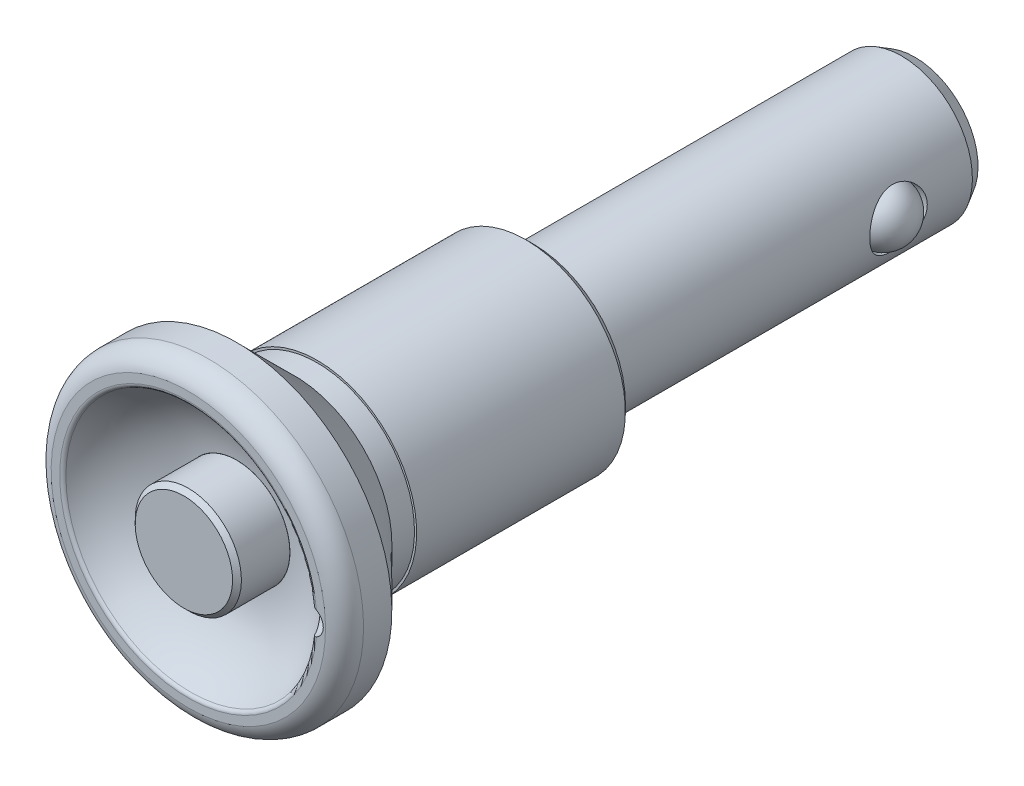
ISO-10303-21;
HEADER;
FILE_DESCRIPTION(('STEP AP214'),'2;1');
FILE_NAME('part.step','',(''),(''),'','','');
FILE_SCHEMA(('AUTOMOTIVE_DESIGN { 1 0 10303 214 1 1 1 1 }'));
ENDSEC;
DATA;
#1=APPLICATION_CONTEXT('core data for automotive mechanical design processes');
#2=APPLICATION_PROTOCOL_DEFINITION('international standard','automotive_design',2000,#1);
#3=PRODUCT_CONTEXT('',#1,'mechanical');
#4=PRODUCT('Part','Part','',(#3));
#5=PRODUCT_RELATED_PRODUCT_CATEGORY('part','',(#4));
#6=PRODUCT_DEFINITION_FORMATION('','',#4);
#7=PRODUCT_DEFINITION_CONTEXT('part definition',#1,'design');
#8=PRODUCT_DEFINITION('design','',#6,#7);
#9=PRODUCT_DEFINITION_SHAPE('','',#8);
#10=(LENGTH_UNIT() NAMED_UNIT(*) SI_UNIT(.MILLI.,.METRE.));
#11=(NAMED_UNIT(*) PLANE_ANGLE_UNIT() SI_UNIT($,.RADIAN.));
#12=(NAMED_UNIT(*) SI_UNIT($,.STERADIAN.) SOLID_ANGLE_UNIT());
#13=UNCERTAINTY_MEASURE_WITH_UNIT(LENGTH_MEASURE(1.E-05),#10,'distance_accuracy_value','');
#14=(GEOMETRIC_REPRESENTATION_CONTEXT(3) GLOBAL_UNCERTAINTY_ASSIGNED_CONTEXT((#13)) GLOBAL_UNIT_ASSIGNED_CONTEXT((#10,
#11,#12)) REPRESENTATION_CONTEXT('',''));
#15=CARTESIAN_POINT('',(0.,0.,0.));
#16=DIRECTION('',(0.,0.,1.));
#17=DIRECTION('',(1.,0.,0.));
#18=AXIS2_PLACEMENT_3D('',#15,#16,#17);
#19=CARTESIAN_POINT('',(9.,0.,-33.25));
#20=DIRECTION('',(1.,0.,0.));
#21=DIRECTION('',(0.,1.,0.));
#22=AXIS2_PLACEMENT_3D('',#19,#20,#21);
#23=CYLINDRICAL_SURFACE('',#22,3.25);
#24=CARTESIAN_POINT('',(-5.63465480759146,3.25,-33.25));
#25=CARTESIAN_POINT('',(-5.63465585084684,3.24999903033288,-33.3347265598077));
#26=CARTESIAN_POINT('',(-5.63657454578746,3.24668003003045,-33.4194635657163));
#27=CARTESIAN_POINT('',(-5.64416687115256,3.23345980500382,-33.5882644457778));
#28=CARTESIAN_POINT('',(-5.64984225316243,3.22355550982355,-33.6723279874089));
#29=CARTESIAN_POINT('',(-5.67225088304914,3.1840842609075,-33.9227685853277));
#30=CARTESIAN_POINT('',(-5.6943660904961,3.14475922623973,-34.0872467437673));
#31=CARTESIAN_POINT('',(-5.74975810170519,3.04227249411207,-34.4053993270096));
#32=CARTESIAN_POINT('',(-5.78297553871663,2.97923736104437,-34.5591260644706));
#33=CARTESIAN_POINT('',(-5.85672343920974,2.8315067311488,-34.8538197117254));
#34=CARTESIAN_POINT('',(-5.89725428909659,2.74681008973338,-34.994785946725));
#35=CARTESIAN_POINT('',(-5.98514477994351,2.54998143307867,-35.2727307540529));
#36=CARTESIAN_POINT('',(-6.03279191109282,2.43616447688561,-35.4084249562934));
#37=CARTESIAN_POINT('',(-6.12722511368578,2.1878300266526,-35.6597995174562));
#38=CARTESIAN_POINT('',(-6.17401074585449,2.05330228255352,-35.7754699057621));
#39=CARTESIAN_POINT('',(-6.26521517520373,1.75630332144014,-35.9911271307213));
#40=CARTESIAN_POINT('',(-6.30926291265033,1.59256097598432,-36.0895350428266));
#41=CARTESIAN_POINT('',(-6.38629670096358,1.2482321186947,-36.2568223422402));
#42=CARTESIAN_POINT('',(-6.41928971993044,1.06765630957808,-36.3257203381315));
#43=CARTESIAN_POINT('',(-6.46842511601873,0.70838520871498,-36.426948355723));
#44=CARTESIAN_POINT('',(-6.48559839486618,0.530468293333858,-36.4615292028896));
#45=CARTESIAN_POINT('',(-6.50500792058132,0.170592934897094,-36.5005535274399));
#46=CARTESIAN_POINT('',(-6.50725319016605,-0.0113630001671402,-36.5050152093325));
#47=CARTESIAN_POINT('',(-6.49704272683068,-0.357230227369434,-36.4845439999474));
#48=CARTESIAN_POINT('',(-6.4858466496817,-0.521336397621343,-36.462129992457));
#49=CARTESIAN_POINT('',(-6.45191454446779,-0.843095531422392,-36.3930510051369));
#50=CARTESIAN_POINT('',(-6.42917765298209,-1.00074801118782,-36.3463842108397));
#51=CARTESIAN_POINT('',(-6.37385308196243,-1.30787680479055,-36.2298199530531));
#52=CARTESIAN_POINT('',(-6.3411333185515,-1.45720962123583,-36.1596096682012));
#53=CARTESIAN_POINT('',(-6.26879358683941,-1.74233451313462,-35.9983862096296));
#54=CARTESIAN_POINT('',(-6.22917114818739,-1.87812171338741,-35.907365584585));
#55=CARTESIAN_POINT('',(-6.14233091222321,-2.14598519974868,-35.6972203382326));
#56=CARTESIAN_POINT('',(-6.09474919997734,-2.27650038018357,-35.5762535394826));
#57=CARTESIAN_POINT('',(-5.99975905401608,-2.5162242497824,-35.3146223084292));
#58=CARTESIAN_POINT('',(-5.95235078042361,-2.62541658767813,-35.1739429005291));
#59=CARTESIAN_POINT('',(-5.85980562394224,-2.82622074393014,-34.8657980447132));
#60=CARTESIAN_POINT('',(-5.81500282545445,-2.91628088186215,-34.6972003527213));
#61=CARTESIAN_POINT('',(-5.75683713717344,-3.02860289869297,-34.4329042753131));
#62=CARTESIAN_POINT('',(-5.73895226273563,-3.06225341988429,-34.3428861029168));
#63=CARTESIAN_POINT('',(-5.70689630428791,-3.12158760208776,-34.1596398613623));
#64=CARTESIAN_POINT('',(-5.69272293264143,-3.14727617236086,-34.0664138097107));
#65=CARTESIAN_POINT('',(-5.66966031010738,-3.18862076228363,-33.8849536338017));
#66=CARTESIAN_POINT('',(-5.66044290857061,-3.2049073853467,-33.7969042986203));
#67=CARTESIAN_POINT('',(-5.64606365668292,-3.23017214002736,-33.6194752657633));
#68=CARTESIAN_POINT('',(-5.64089969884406,-3.23915406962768,-33.5300962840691));
#69=CARTESIAN_POINT('',(-5.63484456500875,-3.24967714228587,-33.3507836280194));
#70=CARTESIAN_POINT('',(-5.63395180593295,-3.25122104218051,-33.2608501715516));
#71=CARTESIAN_POINT('',(-5.63646392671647,-3.24686086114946,-33.0812524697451));
#72=CARTESIAN_POINT('',(-5.63986851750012,-3.24095728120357,-32.9915882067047));
#73=CARTESIAN_POINT('',(-5.65514884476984,-3.21427724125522,-32.7437015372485));
#74=CARTESIAN_POINT('',(-5.67155983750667,-3.18549325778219,-32.5865355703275));
#75=CARTESIAN_POINT('',(-5.71556614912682,-3.10582623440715,-32.2796654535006));
#76=CARTESIAN_POINT('',(-5.74316508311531,-3.05493605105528,-32.1299637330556));
#77=CARTESIAN_POINT('',(-5.80791715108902,-2.93003236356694,-31.8342513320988));
#78=CARTESIAN_POINT('',(-5.84545364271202,-2.85505691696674,-31.6887328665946));
#79=CARTESIAN_POINT('',(-5.92551444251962,-2.68494755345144,-31.4115097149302));
#80=CARTESIAN_POINT('',(-5.96804130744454,-2.58980328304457,-31.2798121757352));
#81=CARTESIAN_POINT('',(-6.0597218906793,-2.36806394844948,-31.0166221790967));
#82=CARTESIAN_POINT('',(-6.10903611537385,-2.23901784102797,-30.8872408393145));
#83=CARTESIAN_POINT('',(-6.20410028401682,-1.96026914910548,-30.6513088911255));
#84=CARTESIAN_POINT('',(-6.24984902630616,-1.81055964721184,-30.5447659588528));
#85=CARTESIAN_POINT('',(-6.33418834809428,-1.48934321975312,-30.3551748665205));
#86=CARTESIAN_POINT('',(-6.3725595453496,-1.31736733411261,-30.272816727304));
#87=CARTESIAN_POINT('',(-6.43615086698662,-0.959533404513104,-30.1390207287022));
#88=CARTESIAN_POINT('',(-6.46138252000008,-0.773687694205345,-30.0875557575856));
#89=CARTESIAN_POINT('',(-6.49401408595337,-0.41178102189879,-30.0214370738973));
#90=CARTESIAN_POINT('',(-6.50283657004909,-0.236384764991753,-30.0038414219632));
#91=CARTESIAN_POINT('',(-6.50610717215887,0.115050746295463,-29.9972911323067));
#92=CARTESIAN_POINT('',(-6.50056030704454,0.291089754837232,-30.0083264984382));
#93=CARTESIAN_POINT('',(-6.47654468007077,0.62662898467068,-30.0567749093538));
#94=CARTESIAN_POINT('',(-6.4589493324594,0.786455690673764,-30.0924062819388));
#95=CARTESIAN_POINT('',(-6.41341105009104,1.09760306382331,-30.1866353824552));
#96=CARTESIAN_POINT('',(-6.38546662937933,1.24892250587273,-30.2452364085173));
#97=CARTESIAN_POINT('',(-6.32026378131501,1.54603651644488,-30.3863521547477));
#98=CARTESIAN_POINT('',(-6.28265782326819,1.69131721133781,-30.4697832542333));
#99=CARTESIAN_POINT('',(-6.20206440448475,1.96642117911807,-30.65704730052));
#100=CARTESIAN_POINT('',(-6.15907447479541,2.09623730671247,-30.7608896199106));
#101=CARTESIAN_POINT('',(-6.06695065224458,2.35031327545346,-30.9979647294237));
#102=CARTESIAN_POINT('',(-6.01763078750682,2.47273842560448,-31.1330928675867));
#103=CARTESIAN_POINT('',(-5.92193632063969,2.69389263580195,-31.4228073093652));
#104=CARTESIAN_POINT('',(-5.87556434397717,2.79260078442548,-31.5774106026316));
#105=CARTESIAN_POINT('',(-5.81174828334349,2.92195709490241,-31.8239315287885));
#106=CARTESIAN_POINT('',(-5.7911601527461,2.96243340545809,-31.91000421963));
#107=CARTESIAN_POINT('',(-5.75300321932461,3.03586895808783,-32.0859253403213));
#108=CARTESIAN_POINT('',(-5.73543286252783,3.06883207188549,-32.175771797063));
#109=CARTESIAN_POINT('',(-5.70405555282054,3.12676668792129,-32.3583807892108));
#110=CARTESIAN_POINT('',(-5.69023892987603,3.15175875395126,-32.451135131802));
#111=CARTESIAN_POINT('',(-5.66692413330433,3.19349036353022,-32.6389664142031));
#112=CARTESIAN_POINT('',(-5.65742293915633,3.21023567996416,-32.7340416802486));
#113=CARTESIAN_POINT('',(-5.64512882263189,3.23178897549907,-32.8993457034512));
#114=CARTESIAN_POINT('',(-5.6412106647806,3.23861149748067,-32.9692357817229));
#115=CARTESIAN_POINT('',(-5.63597313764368,3.24771756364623,-33.1094148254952));
#116=CARTESIAN_POINT('',(-5.63465394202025,3.25000080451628,-33.1797038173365));
#117=CARTESIAN_POINT('',(-5.63465480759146,3.25,-33.25));
#118=B_SPLINE_CURVE_WITH_KNOTS('',3,(#24,#25,#26,#27,#28,#29,#30,#31,#32,#33,#34,#35,#36,#37,
#38,#39,#40,#41,#42,#43,#44,#45,#46,#47,#48,#49,#50,#51,#52,#53,#54,#55,#56,#57,#58,#59,#60,#61,
#62,#63,#64,#65,#66,#67,#68,#69,#70,#71,#72,#73,#74,#75,#76,#77,#78,#79,#80,#81,#82,#83,#84,#85,
#86,#87,#88,#89,#90,#91,#92,#93,#94,#95,#96,#97,#98,#99,#100,#101,#102,#103,#104,#105,#106,#107,
#108,#109,#110,#111,#112,#113,#114,#115,#116,#117),.UNSPECIFIED.,.T.,.F.,(4,2,2,2,2,2,2,2,2,2,2,
2,2,2,2,2,2,2,2,2,2,2,2,2,2,2,2,2,2,2,2,2,2,2,2,2,2,2,2,2,2,2,2,2,2,2,4),(0.,0.254102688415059,
0.508323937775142,1.01720671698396,1.52341076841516,2.0296415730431,2.57756086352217,
3.12575220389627,3.71082834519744,4.29553499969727,4.83868787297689,5.38151242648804,
5.87719988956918,6.37292444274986,6.87551542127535,7.37828663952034,7.92853225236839,
8.47919817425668,9.06474424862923,9.35763698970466,9.65034877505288,9.92001687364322,
10.1895446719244,10.4589725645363,10.7283823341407,11.2078563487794,11.6874854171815,
12.189332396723,12.6914376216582,13.2567245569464,13.8222011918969,14.4025190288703,
14.982326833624,15.5089851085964,16.0354595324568,16.5273252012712,17.0192615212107,
17.5322584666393,18.045491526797,18.6097361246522,19.1744764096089,19.4660899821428,
19.7575529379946,20.0482577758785,20.3387588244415,20.5495694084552,20.7603940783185),.UNSPECIFIED.);
#119=CARTESIAN_POINT('',(-6.04146080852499,-2.41093054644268,-35.429429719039));
#120=VERTEX_POINT('',#119);
#121=CARTESIAN_POINT('',(-6.04146080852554,2.41093054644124,-35.4294297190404));
#122=VERTEX_POINT('',#121);
#123=EDGE_CURVE('E78',#120,#122,#118,.T.);
#124=ORIENTED_EDGE('',*,*,#123,.F.);
#125=CARTESIAN_POINT('',(-6.50475478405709,0.,-36.5));
#126=CARTESIAN_POINT('',(-6.50475472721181,-0.182431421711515,-36.4999918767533));
#127=CARTESIAN_POINT('',(-6.50415200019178,-0.364995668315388,-36.4845876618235));
#128=CARTESIAN_POINT('',(-6.50173100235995,-0.725096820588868,-36.4233526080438));
#129=CARTESIAN_POINT('',(-6.49991125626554,-0.902627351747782,-36.3774848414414));
#130=CARTESIAN_POINT('',(-6.49502786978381,-1.24739374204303,-36.2566336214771));
#131=CARTESIAN_POINT('',(-6.49196480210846,-1.41463430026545,-36.1816635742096));
#132=CARTESIAN_POINT('',(-6.48454055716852,-1.73409069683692,-36.0047703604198));
#133=CARTESIAN_POINT('',(-6.48017978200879,-1.88631116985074,-35.9028555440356));
#134=CARTESIAN_POINT('',(-6.47005616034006,-2.17150162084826,-35.6749545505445));
#135=CARTESIAN_POINT('',(-6.46429309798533,-2.30446863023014,-35.5489646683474));
#136=CARTESIAN_POINT('',(-6.45117895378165,-2.54740669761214,-35.2764608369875));
#137=CARTESIAN_POINT('',(-6.44382727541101,-2.65736908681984,-35.1299391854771));
#138=CARTESIAN_POINT('',(-6.42714023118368,-2.8512229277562,-34.8204831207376));
#139=CARTESIAN_POINT('',(-6.41780288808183,-2.93508818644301,-34.6575324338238));
#140=CARTESIAN_POINT('',(-6.39637595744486,-3.07415122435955,-34.3201765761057));
#141=CARTESIAN_POINT('',(-6.38429049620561,-3.12939158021,-34.1457888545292));
#142=CARTESIAN_POINT('',(-6.36213145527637,-3.1894323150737,-33.8809438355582));
#143=CARTESIAN_POINT('',(-6.35414445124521,-3.20560626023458,-33.7927604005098));
#144=CARTESIAN_POINT('',(-6.33542581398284,-3.23060141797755,-33.6156617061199));
#145=CARTESIAN_POINT('',(-6.32469468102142,-3.239423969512,-33.5267465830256));
#146=CARTESIAN_POINT('',(-6.30342598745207,-3.24711535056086,-33.3937912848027));
#147=CARTESIAN_POINT('',(-6.29549176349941,-3.24875723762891,-33.3496150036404));
#148=CARTESIAN_POINT('',(-6.27882947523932,-3.24969197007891,-33.2959956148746));
#149=CARTESIAN_POINT('',(-6.27515773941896,-3.24982305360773,-33.2853466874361));
#150=CARTESIAN_POINT('',(-6.26890017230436,-3.24992109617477,-33.2727940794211));
#151=CARTESIAN_POINT('',(-6.26755615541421,-3.24993748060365,-33.2703066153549));
#152=CARTESIAN_POINT('',(-6.26457757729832,-3.24996385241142,-33.2655076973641));
#153=CARTESIAN_POINT('',(-6.26294427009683,-3.24997386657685,-33.2631955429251));
#154=CARTESIAN_POINT('',(-6.26029966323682,-3.2499838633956,-33.2602771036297));
#155=CARTESIAN_POINT('',(-6.25950365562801,-3.24998625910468,-33.2594800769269));
#156=CARTESIAN_POINT('',(-6.25780472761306,-3.24999021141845,-33.2580094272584));
#157=CARTESIAN_POINT('',(-6.25690222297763,-3.24999177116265,-33.2573353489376));
#158=CARTESIAN_POINT('',(-6.2553817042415,-3.24999365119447,-33.2564327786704));
#159=CARTESIAN_POINT('',(-6.25480452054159,-3.2499942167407,-33.2561363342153));
#160=CARTESIAN_POINT('',(-6.25361148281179,-3.2499951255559,-33.2556343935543));
#161=CARTESIAN_POINT('',(-6.25299567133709,-3.24999546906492,-33.2554287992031));
#162=CARTESIAN_POINT('',(-6.25172949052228,-3.2499959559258,-33.2551293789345));
#163=CARTESIAN_POINT('',(-6.25107882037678,-3.24999609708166,-33.2550367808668));
#164=CARTESIAN_POINT('',(-6.24977202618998,-3.24999618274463,-33.2549813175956));
#165=CARTESIAN_POINT('',(-6.24911590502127,-3.24999612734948,-33.2550183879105));
#166=CARTESIAN_POINT('',(-6.24790373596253,-3.24999583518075,-33.2552035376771));
#167=CARTESIAN_POINT('',(-6.2473453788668,-3.24999562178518,-33.2553372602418));
#168=CARTESIAN_POINT('',(-6.2462549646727,-3.24999503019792,-33.2556861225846));
#169=CARTESIAN_POINT('',(-6.24572292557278,-3.24999465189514,-33.2559013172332));
#170=CARTESIAN_POINT('',(-6.24435696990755,-3.24999341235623,-33.2565561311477));
#171=CARTESIAN_POINT('',(-6.24354975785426,-3.24999239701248,-33.2570509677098));
#172=CARTESIAN_POINT('',(-6.24201857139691,-3.24998981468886,-33.2581558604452));
#173=CARTESIAN_POINT('',(-6.24129488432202,-3.24998824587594,-33.2587662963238));
#174=CARTESIAN_POINT('',(-6.23885580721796,-3.24998160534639,-33.2610537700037));
#175=CARTESIAN_POINT('',(-6.23732819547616,-3.24997485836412,-33.2629265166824));
#176=CARTESIAN_POINT('',(-6.2345385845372,-3.24995689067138,-33.2668604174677));
#177=CARTESIAN_POINT('',(-6.23327848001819,-3.24994563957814,-33.2689227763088));
#178=CARTESIAN_POINT('',(-6.22754077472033,-3.24987933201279,-33.2791362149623));
#179=CARTESIAN_POINT('',(-6.22414293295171,-3.24979089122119,-33.2878680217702));
#180=CARTESIAN_POINT('',(-6.21809518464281,-3.24953787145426,-33.3055431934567));
#181=CARTESIAN_POINT('',(-6.21544772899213,-3.24937304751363,-33.3144871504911));
#182=CARTESIAN_POINT('',(-6.20329024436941,-3.24836406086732,-33.359005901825));
#183=CARTESIAN_POINT('',(-6.1965662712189,-3.24694993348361,-33.3953332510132));
#184=CARTESIAN_POINT('',(-6.18452276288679,-3.24287823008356,-33.4681644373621));
#185=CARTESIAN_POINT('',(-6.17920844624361,-3.24021613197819,-33.5046684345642));
#186=CARTESIAN_POINT('',(-6.16455650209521,-3.23031427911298,-33.6146776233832));
#187=CARTESIAN_POINT('',(-6.15659209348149,-3.22116857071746,-33.6882307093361));
#188=CARTESIAN_POINT('',(-6.14213641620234,-3.19786349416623,-33.8345240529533));
#189=CARTESIAN_POINT('',(-6.1356431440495,-3.18371101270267,-33.9072652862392));
#190=CARTESIAN_POINT('',(-6.11756290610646,-3.1337105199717,-34.1243002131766));
#191=CARTESIAN_POINT('',(-6.10741258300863,-3.09035068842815,-34.2670577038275));
#192=CARTESIAN_POINT('',(-6.08705596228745,-2.97250185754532,-34.5766439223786));
#193=CARTESIAN_POINT('',(-6.07734814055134,-2.89321109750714,-34.7416864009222));
#194=CARTESIAN_POINT('',(-6.06000127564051,-2.70803402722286,-35.0561997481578));
#195=CARTESIAN_POINT('',(-6.05236213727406,-2.60214894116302,-35.205671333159));
#196=CARTESIAN_POINT('',(-6.03871394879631,-2.36675113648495,-35.4847978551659));
#197=CARTESIAN_POINT('',(-6.03270506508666,-2.23723600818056,-35.6144507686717));
#198=CARTESIAN_POINT('',(-6.02211352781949,-1.95825322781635,-35.8502113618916));
#199=CARTESIAN_POINT('',(-6.01753088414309,-1.80878543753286,-35.9563188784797));
#200=CARTESIAN_POINT('',(-6.00967850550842,-1.4941417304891,-36.1419551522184));
#201=CARTESIAN_POINT('',(-6.00640873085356,-1.32896628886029,-36.2214847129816));
#202=CARTESIAN_POINT('',(-6.00112064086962,-0.987593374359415,-36.3516982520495));
#203=CARTESIAN_POINT('',(-5.99910232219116,-0.811395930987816,-36.4023823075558));
#204=CARTESIAN_POINT('',(-5.99628586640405,-0.453052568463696,-36.4734446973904));
#205=CARTESIAN_POINT('',(-5.99548726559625,-0.270908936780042,-36.4938345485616));
#206=CARTESIAN_POINT('',(-5.99509745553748,0.0942183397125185,-36.5037635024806));
#207=CARTESIAN_POINT('',(-5.99550624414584,0.277201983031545,-36.4933026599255));
#208=CARTESIAN_POINT('',(-5.99753672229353,0.638781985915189,-36.4418331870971));
#209=CARTESIAN_POINT('',(-5.99915820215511,0.817379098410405,-36.4008298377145));
#210=CARTESIAN_POINT('',(-6.00363843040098,1.16515467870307,-36.2894496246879));
#211=CARTESIAN_POINT('',(-6.00649721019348,1.33433290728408,-36.2190720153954));
#212=CARTESIAN_POINT('',(-6.0135025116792,1.65849568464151,-36.0509346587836));
#213=CARTESIAN_POINT('',(-6.01764926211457,1.81347770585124,-35.9531700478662));
#214=CARTESIAN_POINT('',(-6.0273234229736,2.10479333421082,-35.7330763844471));
#215=CARTESIAN_POINT('',(-6.03285058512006,2.24113028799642,-35.6107517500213));
#216=CARTESIAN_POINT('',(-6.04544982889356,2.49132905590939,-35.3450117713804));
#217=CARTESIAN_POINT('',(-6.05252187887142,2.60519133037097,-35.2015968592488));
#218=CARTESIAN_POINT('',(-6.06857069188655,2.80731713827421,-34.8976741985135));
#219=CARTESIAN_POINT('',(-6.07754918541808,2.89555724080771,-34.7371509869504));
#220=CARTESIAN_POINT('',(-6.09807707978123,3.04397016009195,-34.4033061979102));
#221=CARTESIAN_POINT('',(-6.10963108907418,3.10409205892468,-34.2299620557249));
#222=CARTESIAN_POINT('',(-6.13064936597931,3.17169375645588,-33.9649701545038));
#223=CARTESIAN_POINT('',(-6.13825974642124,3.19045596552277,-33.8759096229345));
#224=CARTESIAN_POINT('',(-6.15556946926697,3.22042544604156,-33.6967504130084));
#225=CARTESIAN_POINT('',(-6.16526748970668,3.23163748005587,-33.6066524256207));
#226=CARTESIAN_POINT('',(-6.18408699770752,3.24288271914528,-33.4699792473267));
#227=CARTESIAN_POINT('',(-6.19122596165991,3.24569959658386,-33.4233942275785));
#228=CARTESIAN_POINT('',(-6.20522823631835,3.24841427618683,-33.3541203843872));
#229=CARTESIAN_POINT('',(-6.21044556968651,3.24906738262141,-33.3311266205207));
#230=CARTESIAN_POINT('',(-6.22071764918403,3.24967689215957,-33.2971645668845));
#231=CARTESIAN_POINT('',(-6.22455261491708,3.24981834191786,-33.285924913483));
#232=CARTESIAN_POINT('',(-6.23115042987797,3.24992193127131,-33.2726935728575));
#233=CARTESIAN_POINT('',(-6.2325734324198,3.24993908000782,-33.2700667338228));
#234=CARTESIAN_POINT('',(-6.23574861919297,3.249966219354,-33.2650204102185));
#235=CARTESIAN_POINT('',(-6.23749823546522,3.24997626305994,-33.2625995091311));
#236=CARTESIAN_POINT('',(-6.24023323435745,3.24998546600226,-33.2597477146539));
#237=CARTESIAN_POINT('',(-6.24095037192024,3.24998741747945,-33.2590662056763));
#238=CARTESIAN_POINT('',(-6.24247036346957,3.2499906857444,-33.2578055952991));
#239=CARTESIAN_POINT('',(-6.24327303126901,3.24999200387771,-33.2572262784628));
#240=CARTESIAN_POINT('',(-6.24469100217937,3.24999372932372,-33.2563932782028));
#241=CARTESIAN_POINT('',(-6.24527994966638,3.24999429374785,-33.2560953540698));
#242=CARTESIAN_POINT('',(-6.24649738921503,3.24999519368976,-33.2555949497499));
#243=CARTESIAN_POINT('',(-6.24712582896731,3.24999552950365,-33.2553923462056));
#244=CARTESIAN_POINT('',(-6.24841731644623,3.24999599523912,-33.2551042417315));
#245=CARTESIAN_POINT('',(-6.24908067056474,3.24999612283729,-33.2550200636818));
#246=CARTESIAN_POINT('',(-6.25041071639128,3.24999617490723,-33.2549864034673));
#247=CARTESIAN_POINT('',(-6.25107740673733,3.24999609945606,-33.2550368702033));
#248=CARTESIAN_POINT('',(-6.2522960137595,3.24999576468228,-33.2552474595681));
#249=CARTESIAN_POINT('',(-6.25285091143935,3.24999553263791,-33.2553912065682));
#250=CARTESIAN_POINT('',(-6.2539333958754,3.24999490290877,-33.2557583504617));
#251=CARTESIAN_POINT('',(-6.25446096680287,3.24999450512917,-33.25598179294));
#252=CARTESIAN_POINT('',(-6.25583840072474,3.24999318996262,-33.256667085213));
#253=CARTESIAN_POINT('',(-6.25665912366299,3.24999210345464,-33.2571869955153));
#254=CARTESIAN_POINT('',(-6.25821400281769,3.24998934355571,-33.2583432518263));
#255=CARTESIAN_POINT('',(-6.2589478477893,3.24998766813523,-33.2589799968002));
#256=CARTESIAN_POINT('',(-6.26145971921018,3.24998046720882,-33.2613987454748));
#257=CARTESIAN_POINT('',(-6.2630348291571,3.2499730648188,-33.2633865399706));
#258=CARTESIAN_POINT('',(-6.26590679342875,3.24995329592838,-33.2675538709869));
#259=CARTESIAN_POINT('',(-6.26720163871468,3.24994089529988,-33.2697346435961));
#260=CARTESIAN_POINT('',(-6.27320326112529,3.24986641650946,-33.2807202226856));
#261=CARTESIAN_POINT('',(-6.27673982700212,3.24976552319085,-33.2901364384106));
#262=CARTESIAN_POINT('',(-6.28303094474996,3.24947572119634,-33.3091775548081));
#263=CARTESIAN_POINT('',(-6.28578309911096,3.24928654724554,-33.3188030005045));
#264=CARTESIAN_POINT('',(-6.29841795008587,3.24812694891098,-33.3667085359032));
#265=CARTESIAN_POINT('',(-6.30538389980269,3.24649816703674,-33.4057506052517));
#266=CARTESIAN_POINT('',(-6.3178626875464,3.2418065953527,-33.4839948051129));
#267=CARTESIAN_POINT('',(-6.32337031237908,3.23873876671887,-33.5231970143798));
#268=CARTESIAN_POINT('',(-6.33857182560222,3.22731083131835,-33.6414665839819));
#269=CARTESIAN_POINT('',(-6.34682941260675,3.21674112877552,-33.7205459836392));
#270=CARTESIAN_POINT('',(-6.36180806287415,3.18980788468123,-33.8776933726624));
#271=CARTESIAN_POINT('',(-6.3685310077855,3.17345150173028,-33.9557624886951));
#272=CARTESIAN_POINT('',(-6.38722831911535,3.11568291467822,-34.1883617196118));
#273=CARTESIAN_POINT('',(-6.39769866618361,3.06560179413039,-34.3409675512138));
#274=CARTESIAN_POINT('',(-6.41649095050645,2.94356822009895,-34.6369097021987));
#275=CARTESIAN_POINT('',(-6.42481661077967,2.87165414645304,-34.7802617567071));
#276=CARTESIAN_POINT('',(-6.4398810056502,2.70750791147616,-35.0548470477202));
#277=CARTESIAN_POINT('',(-6.44662026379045,2.61528247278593,-35.1860842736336));
#278=CARTESIAN_POINT('',(-6.45968563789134,2.3981914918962,-35.4510135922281));
#279=CARTESIAN_POINT('',(-6.46582082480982,2.2705610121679,-35.58246220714));
#280=CARTESIAN_POINT('',(-6.47665599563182,1.9949369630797,-35.82218121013));
#281=CARTESIAN_POINT('',(-6.4813549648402,1.84692910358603,-35.9304351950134));
#282=CARTESIAN_POINT('',(-6.4894329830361,1.53479241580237,-36.1205971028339));
#283=CARTESIAN_POINT('',(-6.49281172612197,1.37065986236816,-36.2024989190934));
#284=CARTESIAN_POINT('',(-6.49830922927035,1.0311025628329,-36.3374958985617));
#285=CARTESIAN_POINT('',(-6.50042961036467,0.85569266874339,-36.3906281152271));
#286=CARTESIAN_POINT('',(-6.50287966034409,0.565964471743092,-36.4523665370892));
#287=CARTESIAN_POINT('',(-6.50358302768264,0.453533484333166,-36.4702066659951));
#288=CARTESIAN_POINT('',(-6.50452060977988,0.227418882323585,-36.4940259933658));
#289=CARTESIAN_POINT('',(-6.50475481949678,0.113735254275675,-36.5000050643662));
#290=CARTESIAN_POINT('',(-6.50475478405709,0.,-36.5));
#291=B_SPLINE_CURVE_WITH_KNOTS('',3,(#125,#126,#127,#128,#129,#130,#131,#132,#133,#134,#135,
#136,#137,#138,#139,#140,#141,#142,#143,#144,#145,#146,#147,#148,#149,#150,#151,#152,#153,#154,
#155,#156,#157,#158,#159,#160,#161,#162,#163,#164,#165,#166,#167,#168,#169,#170,#171,#172,#173,
#174,#175,#176,#177,#178,#179,#180,#181,#182,#183,#184,#185,#186,#187,#188,#189,#190,#191,#192,
#193,#194,#195,#196,#197,#198,#199,#200,#201,#202,#203,#204,#205,#206,#207,#208,#209,#210,#211,
#212,#213,#214,#215,#216,#217,#218,#219,#220,#221,#222,#223,#224,#225,#226,#227,#228,#229,#230,
#231,#232,#233,#234,#235,#236,#237,#238,#239,#240,#241,#242,#243,#244,#245,#246,#247,#248,#249,
#250,#251,#252,#253,#254,#255,#256,#257,#258,#259,#260,#261,#262,#263,#264,#265,#266,#267,#268,
#269,#270,#271,#272,#273,#274,#275,#276,#277,#278,#279,#280,#281,#282,#283,#284,#285,#286,#287,
#288,#289,#290),.UNSPECIFIED.,.T.,.F.,(4,2,2,2,2,2,2,2,2,2,2,2,2,2,2,2,2,2,2,2,2,2,2,2,2,2,2,2,
2,2,2,2,2,2,2,2,2,2,2,2,2,2,2,2,2,2,2,2,2,2,2,2,2,2,2,2,2,2,2,2,2,2,2,2,2,2,2,2,2,2,2,2,2,2,2,2,
2,2,2,2,2,2,4),(0.,0.546878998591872,1.09442213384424,1.64171333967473,2.18883513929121,
2.73604120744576,3.28345310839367,3.83141267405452,4.37855484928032,4.64829359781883,
4.9179832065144,5.05238497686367,5.08600715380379,5.09448207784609,5.1029211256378,
5.1062935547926,5.10965322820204,5.11159396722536,5.11353260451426,5.11549212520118,
5.11745067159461,5.11916600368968,5.12088249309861,5.12370644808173,5.12653984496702,
5.13373370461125,5.14097693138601,5.1688896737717,5.19689256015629,5.30747569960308,
5.41846267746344,5.64180446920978,5.86484024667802,6.31195514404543,6.85939401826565,
7.40680769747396,7.95427723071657,8.5017505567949,9.04920732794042,9.5966626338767,
10.1439097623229,10.6911559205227,11.2383074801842,11.7854729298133,12.3327356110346,
12.8798999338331,13.4270530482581,13.9747049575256,14.5233447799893,14.7970709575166,
15.0706243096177,15.2120965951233,15.2828520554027,15.3182754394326,15.3272316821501,
15.3361202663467,15.3390824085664,15.3420382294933,15.3440119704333,15.3459831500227,
15.3479761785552,15.3499684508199,15.3516812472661,15.3533950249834,15.3562927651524,
15.3592005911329,15.3667496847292,15.3743512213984,15.4043178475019,15.4343751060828,
15.5531053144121,15.6722543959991,15.9125314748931,16.1525123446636,16.6334226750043,
17.113492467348,17.5934036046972,18.1407106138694,18.6884034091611,19.2362230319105,
19.7833354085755,20.1242786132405,20.465225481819),.UNSPECIFIED.);
#292=EDGE_CURVE('E62',#122,#120,#291,.T.);
#293=ORIENTED_EDGE('',*,*,#292,.F.);
#294=EDGE_LOOP('',(#124,#293));
#295=FACE_BOUND('',#294,.T.);
#296=CARTESIAN_POINT('',(-7.31009575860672,3.25,-33.25));
#297=CARTESIAN_POINT('',(-7.31009732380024,3.24999819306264,-33.1630599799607));
#298=CARTESIAN_POINT('',(-7.31165386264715,3.24650411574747,-33.076090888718));
#299=CARTESIAN_POINT('',(-7.31782159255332,3.23257358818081,-32.9028024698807));
#300=CARTESIAN_POINT('',(-7.3224347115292,3.22213275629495,-32.8164835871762));
#301=CARTESIAN_POINT('',(-7.34068494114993,3.18046303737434,-32.5591175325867));
#302=CARTESIAN_POINT('',(-7.35873227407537,3.13888730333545,-32.3899262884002));
#303=CARTESIAN_POINT('',(-7.40417815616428,3.03010582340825,-32.0622642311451));
#304=CARTESIAN_POINT('',(-7.43153982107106,2.9630010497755,-31.903754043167));
#305=CARTESIAN_POINT('',(-7.49246721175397,2.80536216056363,-31.6002509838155));
#306=CARTESIAN_POINT('',(-7.5260312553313,2.71483439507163,-31.4552544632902));
#307=CARTESIAN_POINT('',(-7.59780469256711,2.50719740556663,-31.174284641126));
#308=CARTESIAN_POINT('',(-7.63616661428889,2.38892405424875,-31.0392107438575));
#309=CARTESIAN_POINT('',(-7.71195570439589,2.13160039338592,-30.790151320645));
#310=CARTESIAN_POINT('',(-7.74938251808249,1.99254233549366,-30.676173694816));
#311=CARTESIAN_POINT('',(-7.82092244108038,1.69061377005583,-30.4680431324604));
#312=CARTESIAN_POINT('',(-7.85483757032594,1.52700226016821,-30.3748909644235));
#313=CARTESIAN_POINT('',(-7.91367836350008,1.18480623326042,-30.2178173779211));
#314=CARTESIAN_POINT('',(-7.93860783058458,1.00622809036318,-30.1538835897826));
#315=CARTESIAN_POINT('',(-7.97558858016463,0.648594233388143,-30.0602869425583));
#316=CARTESIAN_POINT('',(-7.98821898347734,0.470004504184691,-30.0290769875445));
#317=CARTESIAN_POINT('',(-8.00127556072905,0.109705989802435,-29.9968257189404));
#318=CARTESIAN_POINT('',(-8.00170642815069,-0.072001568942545,-29.9957728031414));
#319=CARTESIAN_POINT('',(-7.99066355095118,-0.422169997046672,-30.0230312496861));
#320=CARTESIAN_POINT('',(-7.97987772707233,-0.590788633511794,-30.0496457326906));
#321=CARTESIAN_POINT('',(-7.94854711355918,-0.920926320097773,-30.1285888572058));
#322=CARTESIAN_POINT('',(-7.92800160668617,-1.08244484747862,-30.1809193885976));
#323=CARTESIAN_POINT('',(-7.87875951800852,-1.39673026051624,-30.3104453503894));
#324=CARTESIAN_POINT('',(-7.84994411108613,-1.54932739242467,-30.3880056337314));
#325=CARTESIAN_POINT('',(-7.78700709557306,-1.83973693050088,-30.5654420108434));
#326=CARTESIAN_POINT('',(-7.75288364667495,-1.97754418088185,-30.6653258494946));
#327=CARTESIAN_POINT('',(-7.68006213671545,-2.2443353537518,-30.8924212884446));
#328=CARTESIAN_POINT('',(-7.6412107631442,-2.37209684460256,-31.0210218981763));
#329=CARTESIAN_POINT('',(-7.56507027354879,-2.60475126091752,-31.2979515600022));
#330=CARTESIAN_POINT('',(-7.52778170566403,-2.70963621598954,-31.4462874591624));
#331=CARTESIAN_POINT('',(-7.45792668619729,-2.89648137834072,-31.7641116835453));
#332=CARTESIAN_POINT('',(-7.42553491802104,-2.97766171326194,-31.9341001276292));
#333=CARTESIAN_POINT('',(-7.37120049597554,-3.10975325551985,-32.2870012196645));
#334=CARTESIAN_POINT('',(-7.34925080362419,-3.16068485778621,-32.4699050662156));
#335=CARTESIAN_POINT('',(-7.32000769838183,-3.22780941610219,-32.8312282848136));
#336=CARTESIAN_POINT('',(-7.31188362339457,-3.24597550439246,-33.0092128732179));
#337=CARTESIAN_POINT('',(-7.30884184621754,-3.25282336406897,-33.365834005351));
#338=CARTESIAN_POINT('',(-7.31391993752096,-3.24151452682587,-33.544470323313));
#339=CARTESIAN_POINT('',(-7.33585566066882,-3.19153169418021,-33.8861339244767));
#340=CARTESIAN_POINT('',(-7.35199401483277,-3.15452692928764,-34.0494573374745));
#341=CARTESIAN_POINT('',(-7.39332962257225,-3.05638531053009,-34.3674592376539));
#342=CARTESIAN_POINT('',(-7.41852892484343,-2.99524299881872,-34.5221357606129));
#343=CARTESIAN_POINT('',(-7.47641704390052,-2.84775217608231,-34.8255746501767));
#344=CARTESIAN_POINT('',(-7.50937194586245,-2.76046786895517,-34.9738297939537));
#345=CARTESIAN_POINT('',(-7.57866264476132,-2.56411776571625,-35.2542780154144));
#346=CARTESIAN_POINT('',(-7.61499984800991,-2.4550428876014,-35.3864643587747));
#347=CARTESIAN_POINT('',(-7.69032288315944,-2.20834452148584,-35.6415580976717));
#348=CARTESIAN_POINT('',(-7.72929827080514,-2.06917373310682,-35.7629779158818));
#349=CARTESIAN_POINT('',(-7.80289864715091,-1.77151095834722,-35.980984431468));
#350=CARTESIAN_POINT('',(-7.83752340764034,-1.6130179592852,-36.0775698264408));
#351=CARTESIAN_POINT('',(-7.89867149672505,-1.28045225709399,-36.2428966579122));
#352=CARTESIAN_POINT('',(-7.9251887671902,-1.10636802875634,-36.311617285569));
#353=CARTESIAN_POINT('',(-7.96701679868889,-0.747763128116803,-36.4183263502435));
#354=CARTESIAN_POINT('',(-7.98233386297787,-0.563248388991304,-36.4563320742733));
#355=CARTESIAN_POINT('',(-7.99934332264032,-0.202353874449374,-36.4984343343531));
#356=CARTESIAN_POINT('',(-8.00187969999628,-0.0262571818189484,-36.5046318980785));
#357=CARTESIAN_POINT('',(-7.99534247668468,0.324389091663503,-36.4885273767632));
#358=CARTESIAN_POINT('',(-7.98627073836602,0.498938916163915,-36.4662298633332));
#359=CARTESIAN_POINT('',(-7.95796712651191,0.835717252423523,-36.3952733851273));
#360=CARTESIAN_POINT('',(-7.93907454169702,0.99816179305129,-36.3474934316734));
#361=CARTESIAN_POINT('',(-7.89317001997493,1.31268916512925,-36.2278639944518));
#362=CARTESIAN_POINT('',(-7.86615650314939,1.46476997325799,-36.1560098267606));
#363=CARTESIAN_POINT('',(-7.80514921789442,1.76171759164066,-35.9866698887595));
#364=CARTESIAN_POINT('',(-7.77089769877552,1.90595939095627,-35.8881831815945));
#365=CARTESIAN_POINT('',(-7.6995172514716,2.17647386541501,-35.6698538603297));
#366=CARTESIAN_POINT('',(-7.66238732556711,2.30274026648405,-35.5500038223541));
#367=CARTESIAN_POINT('',(-7.5864657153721,2.54210677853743,-35.2833069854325));
#368=CARTESIAN_POINT('',(-7.54772000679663,2.65384474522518,-35.1352223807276));
#369=CARTESIAN_POINT('',(-7.47545536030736,2.85108049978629,-34.8210469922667));
#370=CARTESIAN_POINT('',(-7.44193927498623,2.93656399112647,-34.6549464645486));
#371=CARTESIAN_POINT('',(-7.39896255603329,3.04249490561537,-34.3964499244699));
#372=CARTESIAN_POINT('',(-7.38588609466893,3.07401827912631,-34.3090459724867));
#373=CARTESIAN_POINT('',(-7.36253208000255,3.12954209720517,-34.1315309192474));
#374=CARTESIAN_POINT('',(-7.35225317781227,3.15354616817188,-34.0414211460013));
#375=CARTESIAN_POINT('',(-7.33489719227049,3.19370630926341,-33.859430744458));
#376=CARTESIAN_POINT('',(-7.32781154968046,3.20988336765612,-33.7675555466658));
#377=CARTESIAN_POINT('',(-7.31707726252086,3.23427923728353,-33.5826022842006));
#378=CARTESIAN_POINT('',(-7.31342609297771,3.24250389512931,-33.4895251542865));
#379=CARTESIAN_POINT('',(-7.31058346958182,3.24890274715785,-33.3475459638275));
#380=CARTESIAN_POINT('',(-7.31009488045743,3.25000101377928,-33.2987775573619));
#381=CARTESIAN_POINT('',(-7.31009575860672,3.25,-33.25));
#382=B_SPLINE_CURVE_WITH_KNOTS('',3,(#296,#297,#298,#299,#300,#301,#302,#303,#304,#305,#306,
#307,#308,#309,#310,#311,#312,#313,#314,#315,#316,#317,#318,#319,#320,#321,#322,#323,#324,#325,
#326,#327,#328,#329,#330,#331,#332,#333,#334,#335,#336,#337,#338,#339,#340,#341,#342,#343,#344,
#345,#346,#347,#348,#349,#350,#351,#352,#353,#354,#355,#356,#357,#358,#359,#360,#361,#362,#363,
#364,#365,#366,#367,#368,#369,#370,#371,#372,#373,#374,#375,#376,#377,#378,#379,#380,#381),
.UNSPECIFIED.,.T.,.F.,(4,2,2,2,2,2,2,2,2,2,2,2,2,2,2,2,2,2,2,2,2,2,2,2,2,2,2,2,2,2,2,2,2,2,2,2,
2,2,2,2,2,2,4),(0.,0.260777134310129,0.521718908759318,1.04438772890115,1.56501043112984,
2.08549213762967,2.6338545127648,3.18242182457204,3.7534119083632,4.32416003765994,
4.86650613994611,5.40864358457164,5.91938723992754,6.43016843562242,6.94869149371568,
7.46739472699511,8.02109099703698,8.57497987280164,9.14544243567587,9.7155199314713,
10.2499491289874,10.7842080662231,11.2866605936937,11.7892267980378,12.3125257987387,
12.8360433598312,13.3996836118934,13.9633534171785,14.5274433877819,15.091215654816,
15.6172206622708,16.1431412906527,16.6519938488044,17.1609454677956,17.6926147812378,
18.2244692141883,18.7904042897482,19.3566469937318,19.6378242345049,19.9188656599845,
20.1991492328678,20.4792265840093,20.6255351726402),.UNSPECIFIED.);
#383=CARTESIAN_POINT('',(-7.31009575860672,3.25,-33.25));
#384=VERTEX_POINT('',#383);
#385=EDGE_CURVE('E69',#384,#384,#382,.T.);
#386=ORIENTED_EDGE('',*,*,#385,.F.);
#387=EDGE_LOOP('',(#386));
#388=FACE_BOUND('',#387,.T.);
#389=ADVANCED_FACE('F14',(#295,#388),#23,.F.);
#390=CARTESIAN_POINT('',(0.,0.,-43.1));
#391=DIRECTION('',(0.,0.,-1.));
#392=DIRECTION('',(0.,1.,0.));
#393=AXIS2_PLACEMENT_3D('',#390,#391,#392);
#394=CYLINDRICAL_SURFACE('',#393,3.);
#395=CARTESIAN_POINT('',(0.,0.,-37.6));
#396=DIRECTION('',(0.,0.,-1.));
#397=DIRECTION('',(0.,1.,0.));
#398=AXIS2_PLACEMENT_3D('',#395,#396,#397);
#399=CIRCLE('',#398,3.);
#400=CARTESIAN_POINT('',(0.,3.,-37.6));
#401=VERTEX_POINT('',#400);
#402=EDGE_CURVE('E9',#401,#401,#399,.T.);
#403=ORIENTED_EDGE('',*,*,#402,.F.);
#404=EDGE_LOOP('',(#403));
#405=FACE_BOUND('',#404,.T.);
#406=CARTESIAN_POINT('',(0.,0.,-43.1));
#407=DIRECTION('',(0.,0.,-1.));
#408=DIRECTION('',(0.,1.,0.));
#409=AXIS2_PLACEMENT_3D('',#406,#407,#408);
#410=CIRCLE('',#409,3.);
#411=CARTESIAN_POINT('',(0.,3.,-43.1));
#412=VERTEX_POINT('',#411);
#413=EDGE_CURVE('E286',#412,#412,#410,.T.);
#414=ORIENTED_EDGE('',*,*,#413,.T.);
#415=EDGE_LOOP('',(#414));
#416=FACE_BOUND('',#415,.T.);
#417=ADVANCED_FACE('F273',(#405,#416),#394,.F.);
#418=CARTESIAN_POINT('',(0.,0.,-43.1));
#419=DIRECTION('',(0.,0.,-1.));
#420=DIRECTION('',(0.,1.,0.));
#421=AXIS2_PLACEMENT_3D('',#418,#419,#420);
#422=CYLINDRICAL_SURFACE('',#421,8.);
#423=CARTESIAN_POINT('',(0.,0.,0.));
#424=DIRECTION('',(0.,0.,-1.));
#425=DIRECTION('',(0.,1.,0.));
#426=AXIS2_PLACEMENT_3D('',#423,#424,#425);
#427=CIRCLE('',#426,8.);
#428=CARTESIAN_POINT('',(0.,8.,0.));
#429=VERTEX_POINT('',#428);
#430=EDGE_CURVE('E81',#429,#429,#427,.F.);
#431=ORIENTED_EDGE('',*,*,#430,.F.);
#432=EDGE_LOOP('',(#431));
#433=FACE_BOUND('',#432,.T.);
#434=CARTESIAN_POINT('',(7.31009575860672,3.25,-33.25));
#435=CARTESIAN_POINT('',(7.31009732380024,3.24999819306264,-33.3369400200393));
#436=CARTESIAN_POINT('',(7.31165386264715,3.24650411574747,-33.423909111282));
#437=CARTESIAN_POINT('',(7.31782159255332,3.23257358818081,-33.5971975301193));
#438=CARTESIAN_POINT('',(7.3224347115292,3.22213275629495,-33.6835164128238));
#439=CARTESIAN_POINT('',(7.34068494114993,3.18046303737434,-33.9408824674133));
#440=CARTESIAN_POINT('',(7.35873227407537,3.13888730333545,-34.1100737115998));
#441=CARTESIAN_POINT('',(7.40417815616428,3.03010582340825,-34.4377357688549));
#442=CARTESIAN_POINT('',(7.43153982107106,2.9630010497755,-34.596245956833));
#443=CARTESIAN_POINT('',(7.49246721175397,2.80536216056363,-34.8997490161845));
#444=CARTESIAN_POINT('',(7.5260312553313,2.71483439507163,-35.0447455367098));
#445=CARTESIAN_POINT('',(7.59780469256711,2.50719740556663,-35.325715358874));
#446=CARTESIAN_POINT('',(7.63616661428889,2.38892405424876,-35.4607892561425));
#447=CARTESIAN_POINT('',(7.71195570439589,2.13160039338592,-35.709848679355));
#448=CARTESIAN_POINT('',(7.74938251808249,1.99254233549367,-35.823826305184));
#449=CARTESIAN_POINT('',(7.82092244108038,1.69061377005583,-36.0319568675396));
#450=CARTESIAN_POINT('',(7.85483757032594,1.52700226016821,-36.1251090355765));
#451=CARTESIAN_POINT('',(7.91367836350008,1.18480623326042,-36.2821826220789));
#452=CARTESIAN_POINT('',(7.93860783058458,1.00622809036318,-36.3461164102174));
#453=CARTESIAN_POINT('',(7.97558858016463,0.648594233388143,-36.4397130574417));
#454=CARTESIAN_POINT('',(7.98821898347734,0.470004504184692,-36.4709230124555));
#455=CARTESIAN_POINT('',(8.00127556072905,0.109705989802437,-36.5031742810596));
#456=CARTESIAN_POINT('',(8.00170642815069,-0.0720015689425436,-36.5042271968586));
#457=CARTESIAN_POINT('',(7.99066355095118,-0.422169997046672,-36.4769687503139));
#458=CARTESIAN_POINT('',(7.97987772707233,-0.590788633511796,-36.4503542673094));
#459=CARTESIAN_POINT('',(7.94854711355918,-0.920926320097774,-36.3714111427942));
#460=CARTESIAN_POINT('',(7.92800160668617,-1.08244484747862,-36.3190806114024));
#461=CARTESIAN_POINT('',(7.87875951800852,-1.39673026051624,-36.1895546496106));
#462=CARTESIAN_POINT('',(7.84994411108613,-1.54932739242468,-36.1119943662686));
#463=CARTESIAN_POINT('',(7.78700709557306,-1.83973693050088,-35.9345579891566));
#464=CARTESIAN_POINT('',(7.75288364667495,-1.97754418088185,-35.8346741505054));
#465=CARTESIAN_POINT('',(7.68006213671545,-2.2443353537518,-35.6075787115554));
#466=CARTESIAN_POINT('',(7.6412107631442,-2.37209684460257,-35.4789781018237));
#467=CARTESIAN_POINT('',(7.56507027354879,-2.60475126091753,-35.2020484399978));
#468=CARTESIAN_POINT('',(7.52778170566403,-2.70963621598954,-35.0537125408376));
#469=CARTESIAN_POINT('',(7.45792668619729,-2.89648137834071,-34.7358883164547));
#470=CARTESIAN_POINT('',(7.42553491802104,-2.97766171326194,-34.5658998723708));
#471=CARTESIAN_POINT('',(7.37120049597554,-3.10975325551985,-34.2129987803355));
#472=CARTESIAN_POINT('',(7.34925080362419,-3.16068485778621,-34.0300949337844));
#473=CARTESIAN_POINT('',(7.32000769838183,-3.22780941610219,-33.6687717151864));
#474=CARTESIAN_POINT('',(7.31188362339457,-3.24597550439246,-33.4907871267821));
#475=CARTESIAN_POINT('',(7.30884184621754,-3.25282336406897,-33.1341659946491));
#476=CARTESIAN_POINT('',(7.31391993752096,-3.24151452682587,-32.955529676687));
#477=CARTESIAN_POINT('',(7.33585566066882,-3.19153169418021,-32.6138660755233));
#478=CARTESIAN_POINT('',(7.35199401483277,-3.15452692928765,-32.4505426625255));
#479=CARTESIAN_POINT('',(7.39332962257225,-3.05638531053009,-32.1325407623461));
#480=CARTESIAN_POINT('',(7.41852892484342,-2.99524299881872,-31.9778642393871));
#481=CARTESIAN_POINT('',(7.47641704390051,-2.84775217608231,-31.6744253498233));
#482=CARTESIAN_POINT('',(7.50937194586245,-2.76046786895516,-31.5261702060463));
#483=CARTESIAN_POINT('',(7.57866264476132,-2.56411776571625,-31.2457219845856));
#484=CARTESIAN_POINT('',(7.61499984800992,-2.4550428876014,-31.1135356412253));
#485=CARTESIAN_POINT('',(7.69032288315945,-2.20834452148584,-30.8584419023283));
#486=CARTESIAN_POINT('',(7.72929827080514,-2.06917373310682,-30.7370220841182));
#487=CARTESIAN_POINT('',(7.80289864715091,-1.77151095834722,-30.519015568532));
#488=CARTESIAN_POINT('',(7.83752340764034,-1.6130179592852,-30.4224301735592));
#489=CARTESIAN_POINT('',(7.89867149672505,-1.28045225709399,-30.2571033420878));
#490=CARTESIAN_POINT('',(7.9251887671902,-1.10636802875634,-30.188382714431));
#491=CARTESIAN_POINT('',(7.96701679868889,-0.747763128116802,-30.0816736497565));
#492=CARTESIAN_POINT('',(7.98233386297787,-0.563248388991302,-30.0436679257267));
#493=CARTESIAN_POINT('',(7.99934332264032,-0.202353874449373,-30.0015656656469));
#494=CARTESIAN_POINT('',(8.00187969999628,-0.0262571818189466,-29.9953681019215));
#495=CARTESIAN_POINT('',(7.99534247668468,0.324389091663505,-30.0114726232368));
#496=CARTESIAN_POINT('',(7.98627073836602,0.498938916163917,-30.0337701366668));
#497=CARTESIAN_POINT('',(7.95796712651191,0.835717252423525,-30.1047266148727));
#498=CARTESIAN_POINT('',(7.93907454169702,0.998161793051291,-30.1525065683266));
#499=CARTESIAN_POINT('',(7.89317001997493,1.31268916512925,-30.2721360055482));
#500=CARTESIAN_POINT('',(7.86615650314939,1.46476997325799,-30.3439901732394));
#501=CARTESIAN_POINT('',(7.80514921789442,1.76171759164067,-30.5133301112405));
#502=CARTESIAN_POINT('',(7.77089769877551,1.90595939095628,-30.6118168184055));
#503=CARTESIAN_POINT('',(7.6995172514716,2.17647386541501,-30.8301461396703));
#504=CARTESIAN_POINT('',(7.66238732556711,2.30274026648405,-30.9499961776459));
#505=CARTESIAN_POINT('',(7.5864657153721,2.54210677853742,-31.2166930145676));
#506=CARTESIAN_POINT('',(7.54772000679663,2.65384474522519,-31.3647776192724));
#507=CARTESIAN_POINT('',(7.47545536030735,2.85108049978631,-31.6789530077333));
#508=CARTESIAN_POINT('',(7.44193927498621,2.93656399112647,-31.8450535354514));
#509=CARTESIAN_POINT('',(7.39896255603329,3.04249490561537,-32.1035500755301));
#510=CARTESIAN_POINT('',(7.38588609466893,3.07401827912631,-32.1909540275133));
#511=CARTESIAN_POINT('',(7.36253208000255,3.12954209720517,-32.3684690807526));
#512=CARTESIAN_POINT('',(7.35225317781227,3.15354616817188,-32.4585788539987));
#513=CARTESIAN_POINT('',(7.33489719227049,3.19370630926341,-32.640569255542));
#514=CARTESIAN_POINT('',(7.32781154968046,3.20988336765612,-32.7324444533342));
#515=CARTESIAN_POINT('',(7.31707726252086,3.23427923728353,-32.9173977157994));
#516=CARTESIAN_POINT('',(7.31342609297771,3.24250389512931,-33.0104748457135));
#517=CARTESIAN_POINT('',(7.31058346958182,3.24890274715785,-33.1524540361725));
#518=CARTESIAN_POINT('',(7.31009488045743,3.25000101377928,-33.2012224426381));
#519=CARTESIAN_POINT('',(7.31009575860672,3.25,-33.25));
#520=B_SPLINE_CURVE_WITH_KNOTS('',3,(#434,#435,#436,#437,#438,#439,#440,#441,#442,#443,#444,
#445,#446,#447,#448,#449,#450,#451,#452,#453,#454,#455,#456,#457,#458,#459,#460,#461,#462,#463,
#464,#465,#466,#467,#468,#469,#470,#471,#472,#473,#474,#475,#476,#477,#478,#479,#480,#481,#482,
#483,#484,#485,#486,#487,#488,#489,#490,#491,#492,#493,#494,#495,#496,#497,#498,#499,#500,#501,
#502,#503,#504,#505,#506,#507,#508,#509,#510,#511,#512,#513,#514,#515,#516,#517,#518,#519),
.UNSPECIFIED.,.T.,.F.,(4,2,2,2,2,2,2,2,2,2,2,2,2,2,2,2,2,2,2,2,2,2,2,2,2,2,2,2,2,2,2,2,2,2,2,2,
2,2,2,2,2,2,4),(0.,0.260777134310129,0.521718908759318,1.04438772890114,1.56501043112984,
2.08549213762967,2.6338545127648,3.18242182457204,3.7534119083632,4.32416003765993,
4.86650613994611,5.40864358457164,5.91938723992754,6.43016843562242,6.94869149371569,
7.46739472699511,8.02109099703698,8.57497987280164,9.14544243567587,9.71551993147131,
10.2499491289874,10.7842080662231,11.2866605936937,11.7892267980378,12.3125257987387,
12.8360433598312,13.3996836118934,13.9633534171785,14.5274433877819,15.091215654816,
15.6172206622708,16.1431412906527,16.6519938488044,17.1609454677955,17.6926147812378,
18.2244692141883,18.7904042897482,19.3566469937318,19.6378242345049,19.9188656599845,
20.1991492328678,20.4792265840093,20.6255351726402),.UNSPECIFIED.);
#521=CARTESIAN_POINT('',(7.31009575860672,3.25,-33.25));
#522=VERTEX_POINT('',#521);
#523=EDGE_CURVE('E278',#522,#522,#520,.T.);
#524=ORIENTED_EDGE('',*,*,#523,.T.);
#525=EDGE_LOOP('',(#524));
#526=FACE_BOUND('',#525,.T.);
#527=CARTESIAN_POINT('',(0.,0.,-41.6));
#528=DIRECTION('',(0.,0.,-1.));
#529=DIRECTION('',(0.,1.,0.));
#530=AXIS2_PLACEMENT_3D('',#527,#528,#529);
#531=CIRCLE('',#530,8.);
#532=CARTESIAN_POINT('',(0.,8.,-41.6));
#533=VERTEX_POINT('',#532);
#534=EDGE_CURVE('E75',#533,#533,#531,.T.);
#535=ORIENTED_EDGE('',*,*,#534,.F.);
#536=EDGE_LOOP('',(#535));
#537=FACE_BOUND('',#536,.T.);
#538=ORIENTED_EDGE('',*,*,#385,.T.);
#539=EDGE_LOOP('',(#538));
#540=FACE_BOUND('',#539,.T.);
#541=ADVANCED_FACE('F269',(#433,#526,#537,#540),#422,.T.);
#542=CARTESIAN_POINT('',(3.,0.,-43.1));
#543=DIRECTION('',(0.,0.,-1.));
#544=DIRECTION('',(0.,1.,0.));
#545=AXIS2_PLACEMENT_3D('',#542,#543,#544);
#546=PLANE('',#545);
#547=CARTESIAN_POINT('',(0.,0.,-43.1));
#548=DIRECTION('',(0.,0.,-1.));
#549=DIRECTION('',(0.,1.,0.));
#550=AXIS2_PLACEMENT_3D('',#547,#548,#549);
#551=CIRCLE('',#550,7.13397459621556);
#552=CARTESIAN_POINT('',(0.,7.13397459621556,-43.1));
#553=VERTEX_POINT('',#552);
#554=EDGE_CURVE('E322',#553,#553,#551,.T.);
#555=ORIENTED_EDGE('',*,*,#554,.T.);
#556=EDGE_LOOP('',(#555));
#557=FACE_BOUND('',#556,.T.);
#558=ORIENTED_EDGE('',*,*,#413,.F.);
#559=EDGE_LOOP('',(#558));
#560=FACE_BOUND('',#559,.T.);
#561=ADVANCED_FACE('F272',(#557,#560),#546,.T.);
#562=CARTESIAN_POINT('',(0.,0.,-43.1));
#563=DIRECTION('',(0.,0.,1.));
#564=DIRECTION('',(0.,-1.,0.));
#565=AXIS2_PLACEMENT_3D('',#562,#563,#564);
#566=CONICAL_SURFACE('',#565,7.13397459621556,0.523598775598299);
#567=ORIENTED_EDGE('',*,*,#534,.T.);
#568=EDGE_LOOP('',(#567));
#569=FACE_BOUND('',#568,.T.);
#570=ORIENTED_EDGE('',*,*,#554,.F.);
#571=EDGE_LOOP('',(#570));
#572=FACE_BOUND('',#571,.T.);
#573=ADVANCED_FACE('F302',(#569,#572),#566,.T.);
#574=CARTESIAN_POINT('',(5.63465480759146,3.25,-33.25));
#575=CARTESIAN_POINT('',(5.63465585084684,3.24999903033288,-33.1652734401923));
#576=CARTESIAN_POINT('',(5.63657454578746,3.24668003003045,-33.0805364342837));
#577=CARTESIAN_POINT('',(5.64416687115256,3.23345980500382,-32.9117355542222));
#578=CARTESIAN_POINT('',(5.64984225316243,3.22355550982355,-32.8276720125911));
#579=CARTESIAN_POINT('',(5.67225088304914,3.1840842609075,-32.5772314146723));
#580=CARTESIAN_POINT('',(5.6943660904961,3.14475922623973,-32.4127532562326));
#581=CARTESIAN_POINT('',(5.74975810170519,3.04227249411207,-32.0946006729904));
#582=CARTESIAN_POINT('',(5.78297553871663,2.97923736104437,-31.9408739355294));
#583=CARTESIAN_POINT('',(5.85672343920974,2.83150673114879,-31.6461802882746));
#584=CARTESIAN_POINT('',(5.89725428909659,2.74681008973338,-31.505214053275));
#585=CARTESIAN_POINT('',(5.98514477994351,2.54998143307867,-31.2272692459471));
#586=CARTESIAN_POINT('',(6.03279191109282,2.43616447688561,-31.0915750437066));
#587=CARTESIAN_POINT('',(6.12722511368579,2.1878300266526,-30.8402004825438));
#588=CARTESIAN_POINT('',(6.17401074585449,2.05330228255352,-30.7245300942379));
#589=CARTESIAN_POINT('',(6.26521517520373,1.75630332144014,-30.5088728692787));
#590=CARTESIAN_POINT('',(6.30926291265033,1.59256097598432,-30.4104649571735));
#591=CARTESIAN_POINT('',(6.38629670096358,1.2482321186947,-30.2431776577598));
#592=CARTESIAN_POINT('',(6.41928971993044,1.06765630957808,-30.1742796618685));
#593=CARTESIAN_POINT('',(6.46842511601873,0.70838520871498,-30.073051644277));
#594=CARTESIAN_POINT('',(6.48559839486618,0.53046829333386,-30.0384707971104));
#595=CARTESIAN_POINT('',(6.50500792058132,0.170592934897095,-29.9994464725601));
#596=CARTESIAN_POINT('',(6.50725319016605,-0.0113630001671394,-29.9949847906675));
#597=CARTESIAN_POINT('',(6.49704272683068,-0.357230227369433,-30.0154560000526));
#598=CARTESIAN_POINT('',(6.4858466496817,-0.521336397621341,-30.037870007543));
#599=CARTESIAN_POINT('',(6.45191454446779,-0.843095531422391,-30.1069489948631));
#600=CARTESIAN_POINT('',(6.42917765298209,-1.00074801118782,-30.1536157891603));
#601=CARTESIAN_POINT('',(6.37385308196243,-1.30787680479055,-30.270180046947));
#602=CARTESIAN_POINT('',(6.3411333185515,-1.45720962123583,-30.3403903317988));
#603=CARTESIAN_POINT('',(6.26879358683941,-1.74233451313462,-30.5016137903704));
#604=CARTESIAN_POINT('',(6.22917114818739,-1.87812171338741,-30.592634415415));
#605=CARTESIAN_POINT('',(6.14233091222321,-2.14598519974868,-30.8027796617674));
#606=CARTESIAN_POINT('',(6.09474919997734,-2.27650038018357,-30.9237464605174));
#607=CARTESIAN_POINT('',(5.99975905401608,-2.51622424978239,-31.1853776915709));
#608=CARTESIAN_POINT('',(5.95235078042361,-2.62541658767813,-31.3260570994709));
#609=CARTESIAN_POINT('',(5.85980562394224,-2.82622074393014,-31.6342019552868));
#610=CARTESIAN_POINT('',(5.81500282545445,-2.91628088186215,-31.8027996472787));
#611=CARTESIAN_POINT('',(5.75683713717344,-3.02860289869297,-32.0670957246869));
#612=CARTESIAN_POINT('',(5.73895226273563,-3.06225341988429,-32.1571138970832));
#613=CARTESIAN_POINT('',(5.70689630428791,-3.12158760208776,-32.3403601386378));
#614=CARTESIAN_POINT('',(5.69272293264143,-3.14727617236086,-32.4335861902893));
#615=CARTESIAN_POINT('',(5.66966031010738,-3.18862076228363,-32.6150463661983));
#616=CARTESIAN_POINT('',(5.66044290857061,-3.2049073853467,-32.7030957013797));
#617=CARTESIAN_POINT('',(5.64606365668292,-3.23017214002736,-32.8805247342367));
#618=CARTESIAN_POINT('',(5.64089969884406,-3.23915406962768,-32.9699037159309));
#619=CARTESIAN_POINT('',(5.63484456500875,-3.24967714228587,-33.1492163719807));
#620=CARTESIAN_POINT('',(5.63395180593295,-3.25122104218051,-33.2391498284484));
#621=CARTESIAN_POINT('',(5.63646392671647,-3.24686086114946,-33.4187475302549));
#622=CARTESIAN_POINT('',(5.63986851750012,-3.24095728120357,-33.5084117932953));
#623=CARTESIAN_POINT('',(5.65514884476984,-3.21427724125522,-33.7562984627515));
#624=CARTESIAN_POINT('',(5.67155983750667,-3.18549325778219,-33.9134644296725));
#625=CARTESIAN_POINT('',(5.71556614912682,-3.10582623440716,-34.2203345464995));
#626=CARTESIAN_POINT('',(5.74316508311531,-3.05493605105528,-34.3700362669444));
#627=CARTESIAN_POINT('',(5.80791715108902,-2.93003236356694,-34.6657486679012));
#628=CARTESIAN_POINT('',(5.84545364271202,-2.85505691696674,-34.8112671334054));
#629=CARTESIAN_POINT('',(5.92551444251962,-2.68494755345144,-35.0884902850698));
#630=CARTESIAN_POINT('',(5.96804130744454,-2.58980328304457,-35.2201878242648));
#631=CARTESIAN_POINT('',(6.0597218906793,-2.36806394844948,-35.4833778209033));
#632=CARTESIAN_POINT('',(6.10903611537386,-2.23901784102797,-35.6127591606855));
#633=CARTESIAN_POINT('',(6.20410028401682,-1.96026914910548,-35.8486911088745));
#634=CARTESIAN_POINT('',(6.24984902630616,-1.81055964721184,-35.9552340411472));
#635=CARTESIAN_POINT('',(6.33418834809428,-1.48934321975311,-36.1448251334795));
#636=CARTESIAN_POINT('',(6.3725595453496,-1.31736733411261,-36.227183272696));
#637=CARTESIAN_POINT('',(6.43615086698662,-0.959533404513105,-36.3609792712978));
#638=CARTESIAN_POINT('',(6.46138252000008,-0.773687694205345,-36.4124442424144));
#639=CARTESIAN_POINT('',(6.49401408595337,-0.41178102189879,-36.4785629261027));
#640=CARTESIAN_POINT('',(6.50283657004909,-0.236384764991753,-36.4961585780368));
#641=CARTESIAN_POINT('',(6.50610717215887,0.115050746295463,-36.5027088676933));
#642=CARTESIAN_POINT('',(6.50056030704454,0.291089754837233,-36.4916735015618));
#643=CARTESIAN_POINT('',(6.47654468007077,0.626628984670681,-36.4432250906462));
#644=CARTESIAN_POINT('',(6.4589493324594,0.786455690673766,-36.4075937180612));
#645=CARTESIAN_POINT('',(6.41341105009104,1.09760306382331,-36.3133646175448));
#646=CARTESIAN_POINT('',(6.38546662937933,1.24892250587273,-36.2547635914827));
#647=CARTESIAN_POINT('',(6.32026378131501,1.54603651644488,-36.1136478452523));
#648=CARTESIAN_POINT('',(6.28265782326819,1.69131721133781,-36.0302167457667));
#649=CARTESIAN_POINT('',(6.20206440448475,1.96642117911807,-35.84295269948));
#650=CARTESIAN_POINT('',(6.15907447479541,2.09623730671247,-35.7391103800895));
#651=CARTESIAN_POINT('',(6.06695065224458,2.35031327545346,-35.5020352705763));
#652=CARTESIAN_POINT('',(6.01763078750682,2.47273842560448,-35.3669071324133));
#653=CARTESIAN_POINT('',(5.92193632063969,2.69389263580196,-35.0771926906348));
#654=CARTESIAN_POINT('',(5.87556434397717,2.79260078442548,-34.9225893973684));
#655=CARTESIAN_POINT('',(5.81174828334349,2.92195709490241,-34.6760684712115));
#656=CARTESIAN_POINT('',(5.7911601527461,2.96243340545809,-34.58999578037));
#657=CARTESIAN_POINT('',(5.75300321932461,3.03586895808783,-34.4140746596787));
#658=CARTESIAN_POINT('',(5.73543286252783,3.06883207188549,-34.324228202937));
#659=CARTESIAN_POINT('',(5.70405555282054,3.12676668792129,-34.1416192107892));
#660=CARTESIAN_POINT('',(5.69023892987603,3.15175875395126,-34.048864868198));
#661=CARTESIAN_POINT('',(5.66692413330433,3.19349036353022,-33.8610335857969));
#662=CARTESIAN_POINT('',(5.65742293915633,3.21023567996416,-33.7659583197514));
#663=CARTESIAN_POINT('',(5.64512882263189,3.23178897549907,-33.6006542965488));
#664=CARTESIAN_POINT('',(5.6412106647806,3.23861149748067,-33.5307642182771));
#665=CARTESIAN_POINT('',(5.63597313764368,3.24771756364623,-33.3905851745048));
#666=CARTESIAN_POINT('',(5.63465394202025,3.25000080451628,-33.3202961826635));
#667=CARTESIAN_POINT('',(5.63465480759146,3.25,-33.25));
#668=B_SPLINE_CURVE_WITH_KNOTS('',3,(#574,#575,#576,#577,#578,#579,#580,#581,#582,#583,#584,
#585,#586,#587,#588,#589,#590,#591,#592,#593,#594,#595,#596,#597,#598,#599,#600,#601,#602,#603,
#604,#605,#606,#607,#608,#609,#610,#611,#612,#613,#614,#615,#616,#617,#618,#619,#620,#621,#622,
#623,#624,#625,#626,#627,#628,#629,#630,#631,#632,#633,#634,#635,#636,#637,#638,#639,#640,#641,
#642,#643,#644,#645,#646,#647,#648,#649,#650,#651,#652,#653,#654,#655,#656,#657,#658,#659,#660,
#661,#662,#663,#664,#665,#666,#667),.UNSPECIFIED.,.T.,.F.,(4,2,2,2,2,2,2,2,2,2,2,2,2,2,2,2,2,2,
2,2,2,2,2,2,2,2,2,2,2,2,2,2,2,2,2,2,2,2,2,2,2,2,2,2,2,2,4),(0.,0.254102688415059,
0.508323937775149,1.01720671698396,1.52341076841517,2.0296415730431,2.57756086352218,
3.12575220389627,3.71082834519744,4.29553499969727,4.83868787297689,5.38151242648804,
5.87719988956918,6.37292444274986,6.87551542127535,7.37828663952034,7.9285322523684,
8.47919817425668,9.06474424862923,9.35763698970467,9.65034877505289,9.92001687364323,
10.1895446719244,10.4589725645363,10.7283823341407,11.2078563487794,11.6874854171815,
12.189332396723,12.6914376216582,13.2567245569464,13.8222011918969,14.4025190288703,
14.982326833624,15.5089851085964,16.0354595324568,16.5273252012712,17.0192615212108,
17.5322584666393,18.045491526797,18.6097361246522,19.1744764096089,19.4660899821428,
19.7575529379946,20.0482577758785,20.3387588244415,20.5495694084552,20.7603940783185),.UNSPECIFIED.);
#669=CARTESIAN_POINT('',(6.04146080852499,2.41093054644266,-35.429429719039));
#670=VERTEX_POINT('',#669);
#671=CARTESIAN_POINT('',(6.04146080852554,-2.41093054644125,-35.4294297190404));
#672=VERTEX_POINT('',#671);
#673=EDGE_CURVE('E71',#670,#672,#668,.T.);
#674=ORIENTED_EDGE('',*,*,#673,.F.);
#675=CARTESIAN_POINT('',(6.50475478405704,0.,-36.5));
#676=CARTESIAN_POINT('',(6.50475472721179,0.182431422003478,-36.4999918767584));
#677=CARTESIAN_POINT('',(6.50415200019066,0.364995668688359,-36.4845876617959));
#678=CARTESIAN_POINT('',(6.50173100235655,0.725096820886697,-36.4233526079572));
#679=CARTESIAN_POINT('',(6.49991125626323,0.90262735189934,-36.3774848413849));
#680=CARTESIAN_POINT('',(6.49502786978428,1.24739374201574,-36.2566336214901));
#681=CARTESIAN_POINT('',(6.49196480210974,1.41463430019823,-36.1816635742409));
#682=CARTESIAN_POINT('',(6.48454055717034,1.73409069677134,-36.0047703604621));
#683=CARTESIAN_POINT('',(6.48017978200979,1.88631116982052,-35.9028555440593));
#684=CARTESIAN_POINT('',(6.47005616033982,2.17150162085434,-35.6749545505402));
#685=CARTESIAN_POINT('',(6.4642930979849,2.30446863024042,-35.5489646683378));
#686=CARTESIAN_POINT('',(6.45117895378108,2.54740669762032,-35.2764608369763));
#687=CARTESIAN_POINT('',(6.44382727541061,2.65736908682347,-35.1299391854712));
#688=CARTESIAN_POINT('',(6.42714023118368,2.85122292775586,-34.8204831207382));
#689=CARTESIAN_POINT('',(6.41780288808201,2.93508818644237,-34.657532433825));
#690=CARTESIAN_POINT('',(6.39637595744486,3.07415122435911,-34.3201765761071));
#691=CARTESIAN_POINT('',(6.38429049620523,3.12939158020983,-34.1457888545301));
#692=CARTESIAN_POINT('',(6.36213145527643,3.18943231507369,-33.8809438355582));
#693=CARTESIAN_POINT('',(6.35414445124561,3.20560626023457,-33.7927604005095));
#694=CARTESIAN_POINT('',(6.33542581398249,3.23060141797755,-33.6156617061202));
#695=CARTESIAN_POINT('',(6.32469468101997,3.23942396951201,-33.5267465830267));
#696=CARTESIAN_POINT('',(6.30342598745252,3.24711535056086,-33.3937912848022));
#697=CARTESIAN_POINT('',(6.29549176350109,3.2487572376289,-33.3496150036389));
#698=CARTESIAN_POINT('',(6.27882947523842,3.24969197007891,-33.295995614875));
#699=CARTESIAN_POINT('',(6.27515773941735,3.24982305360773,-33.285346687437));
#700=CARTESIAN_POINT('',(6.26890017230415,3.24992109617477,-33.2727940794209));
#701=CARTESIAN_POINT('',(6.26755615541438,3.24993748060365,-33.2703066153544));
#702=CARTESIAN_POINT('',(6.26457757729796,3.24996385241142,-33.2655076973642));
#703=CARTESIAN_POINT('',(6.26294427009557,3.24997386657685,-33.263195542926));
#704=CARTESIAN_POINT('',(6.26029966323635,3.2499838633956,-33.2602771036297));
#705=CARTESIAN_POINT('',(6.25950365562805,3.24998625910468,-33.2594800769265));
#706=CARTESIAN_POINT('',(6.25780472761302,3.24999021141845,-33.2580094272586));
#707=CARTESIAN_POINT('',(6.25690222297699,3.24999177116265,-33.2573353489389));
#708=CARTESIAN_POINT('',(6.25538170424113,3.24999365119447,-33.2564327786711));
#709=CARTESIAN_POINT('',(6.25480452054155,3.2499942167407,-33.2561363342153));
#710=CARTESIAN_POINT('',(6.25361148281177,3.2499951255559,-33.2556343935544));
#711=CARTESIAN_POINT('',(6.25299567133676,3.24999546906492,-33.2554287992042));
#712=CARTESIAN_POINT('',(6.25172949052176,3.2499959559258,-33.2551293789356));
#713=CARTESIAN_POINT('',(6.25107882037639,3.24999609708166,-33.2550367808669));
#714=CARTESIAN_POINT('',(6.24977202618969,3.24999618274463,-33.2549813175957));
#715=CARTESIAN_POINT('',(6.24911590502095,3.24999612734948,-33.2550183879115));
#716=CARTESIAN_POINT('',(6.24790373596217,3.24999583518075,-33.2552035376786));
#717=CARTESIAN_POINT('',(6.24734537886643,3.24999562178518,-33.255337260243));
#718=CARTESIAN_POINT('',(6.24625496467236,3.24999503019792,-33.2556861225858));
#719=CARTESIAN_POINT('',(6.24572292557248,3.24999465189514,-33.2559013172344));
#720=CARTESIAN_POINT('',(6.24435696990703,3.24999341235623,-33.2565561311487));
#721=CARTESIAN_POINT('',(6.24354975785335,3.24999239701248,-33.2570509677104));
#722=CARTESIAN_POINT('',(6.24201857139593,3.24998981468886,-33.2581558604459));
#723=CARTESIAN_POINT('',(6.24129488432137,3.24998824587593,-33.2587662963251));
#724=CARTESIAN_POINT('',(6.2388558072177,3.24998160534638,-33.2610537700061));
#725=CARTESIAN_POINT('',(6.23732819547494,3.24997485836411,-33.2629265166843));
#726=CARTESIAN_POINT('',(6.23453858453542,3.24995689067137,-33.2668604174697));
#727=CARTESIAN_POINT('',(6.23327848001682,3.24994563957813,-33.2689227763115));
#728=CARTESIAN_POINT('',(6.22754077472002,3.24987933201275,-33.2791362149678));
#729=CARTESIAN_POINT('',(6.22414293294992,3.24979089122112,-33.2878680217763));
#730=CARTESIAN_POINT('',(6.21809518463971,3.24953787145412,-33.305543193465));
#731=CARTESIAN_POINT('',(6.2154477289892,3.24937304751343,-33.3144871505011));
#732=CARTESIAN_POINT('',(6.20329024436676,3.2483640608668,-33.359005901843));
#733=CARTESIAN_POINT('',(6.1965662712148,3.24694993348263,-33.3953332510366));
#734=CARTESIAN_POINT('',(6.18452276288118,3.24287823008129,-33.4681644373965));
#735=CARTESIAN_POINT('',(6.17920844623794,3.2402161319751,-33.5046684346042));
#736=CARTESIAN_POINT('',(6.16455650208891,3.23031427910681,-33.6146776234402));
#737=CARTESIAN_POINT('',(6.15659209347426,3.22116857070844,-33.6882307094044));
#738=CARTESIAN_POINT('',(6.14213641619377,3.1978634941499,-33.8345240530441));
#739=CARTESIAN_POINT('',(6.1356431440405,3.18371101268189,-33.9072652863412));
#740=CARTESIAN_POINT('',(6.11756290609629,3.13371051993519,-34.1243002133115));
#741=CARTESIAN_POINT('',(6.10741258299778,3.09035068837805,-34.2670577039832));
#742=CARTESIAN_POINT('',(6.08705596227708,2.97250185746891,-34.5766439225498));
#743=CARTESIAN_POINT('',(6.07734814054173,2.89321109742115,-34.741686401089));
#744=CARTESIAN_POINT('',(6.06000127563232,2.70803402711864,-35.0561997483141));
#745=CARTESIAN_POINT('',(6.05236213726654,2.60214894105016,-35.2056713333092));
#746=CARTESIAN_POINT('',(6.03871394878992,2.36675113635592,-35.4847978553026));
#747=CARTESIAN_POINT('',(6.03270506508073,2.237236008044,-35.6144507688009));
#748=CARTESIAN_POINT('',(6.02211352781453,1.95825322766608,-35.8502113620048));
#749=CARTESIAN_POINT('',(6.01753088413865,1.80878543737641,-35.9563188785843));
#750=CARTESIAN_POINT('',(6.00967850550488,1.49414173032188,-36.1419551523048));
#751=CARTESIAN_POINT('',(6.00640873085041,1.32896628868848,-36.2214847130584));
#752=CARTESIAN_POINT('',(6.00112064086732,0.987593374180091,-36.3516982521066));
#753=CARTESIAN_POINT('',(5.99910232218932,0.811395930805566,-36.4023823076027));
#754=CARTESIAN_POINT('',(5.99628586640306,0.453052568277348,-36.4734446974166));
#755=CARTESIAN_POINT('',(5.99548726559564,0.27090893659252,-36.4938345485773));
#756=CARTESIAN_POINT('',(5.9950974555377,-0.0942183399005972,-36.5037635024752));
#757=CARTESIAN_POINT('',(5.99550624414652,-0.277201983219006,-36.4933026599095));
#758=CARTESIAN_POINT('',(5.99753672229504,-0.638781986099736,-36.4418331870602));
#759=CARTESIAN_POINT('',(5.99915820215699,-0.817379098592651,-36.4008298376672));
#760=CARTESIAN_POINT('',(6.00363843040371,-1.16515467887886,-36.2894496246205));
#761=CARTESIAN_POINT('',(6.00649721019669,-1.33433290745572,-36.2190720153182));
#762=CARTESIAN_POINT('',(6.01350251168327,-1.65849568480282,-36.0509346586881));
#763=CARTESIAN_POINT('',(6.01764926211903,-1.81347770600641,-35.953170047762));
#764=CARTESIAN_POINT('',(6.02732342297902,-2.10479333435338,-35.7330763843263));
#765=CARTESIAN_POINT('',(6.03285058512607,-2.24113028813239,-35.6107517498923));
#766=CARTESIAN_POINT('',(6.04544982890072,-2.49132905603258,-35.3450117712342));
#767=CARTESIAN_POINT('',(6.05252187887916,-2.60519133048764,-35.2015968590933));
#768=CARTESIAN_POINT('',(6.06857069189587,-2.80731713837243,-34.8976741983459));
#769=CARTESIAN_POINT('',(6.07754918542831,-2.89555724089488,-34.7371509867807));
#770=CARTESIAN_POINT('',(6.09807707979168,-3.04397016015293,-34.4033061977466));
#771=CARTESIAN_POINT('',(6.10963108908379,-3.10409205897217,-34.2299620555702));
#772=CARTESIAN_POINT('',(6.13064936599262,-3.17169375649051,-33.9649701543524));
#773=CARTESIAN_POINT('',(6.13825974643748,-3.19045596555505,-33.8759096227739));
#774=CARTESIAN_POINT('',(6.15556946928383,-3.22042544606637,-33.6967504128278));
#775=CARTESIAN_POINT('',(6.16526748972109,-3.23163748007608,-33.6066524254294));
#776=CARTESIAN_POINT('',(6.18408699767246,-3.24288271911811,-33.4699792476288));
#777=CARTESIAN_POINT('',(6.19122596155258,-3.24569959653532,-33.4233942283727));
#778=CARTESIAN_POINT('',(6.2052282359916,-3.24841427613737,-33.3541203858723));
#779=CARTESIAN_POINT('',(6.21044556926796,-3.24906738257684,-33.3311266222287));
#780=CARTESIAN_POINT('',(6.22071764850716,-3.24967689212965,-33.2971645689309));
#781=CARTESIAN_POINT('',(6.22455261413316,-3.24981834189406,-33.2859249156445));
#782=CARTESIAN_POINT('',(6.23115042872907,-3.2499219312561,-33.2726935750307));
#783=CARTESIAN_POINT('',(6.23257343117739,-3.24993907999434,-33.2700667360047));
#784=CARTESIAN_POINT('',(6.23574861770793,-3.24996621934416,-33.2650204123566));
#785=CARTESIAN_POINT('',(6.23749823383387,-3.24997626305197,-33.2625995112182));
#786=CARTESIAN_POINT('',(6.2402332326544,-3.24998546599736,-33.2597477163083));
#787=CARTESIAN_POINT('',(6.24095037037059,-3.24998741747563,-33.2590662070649));
#788=CARTESIAN_POINT('',(6.2424703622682,-3.2499906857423,-33.2578055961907));
#789=CARTESIAN_POINT('',(6.24327303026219,-3.24999200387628,-33.2572262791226));
#790=CARTESIAN_POINT('',(6.24469100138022,-3.24999372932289,-33.2563932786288));
#791=CARTESIAN_POINT('',(6.24527994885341,-3.24999429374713,-33.2560953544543));
#792=CARTESIAN_POINT('',(6.24649738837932,-3.24999519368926,-33.2555949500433));
#793=CARTESIAN_POINT('',(6.2471258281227,-3.24999552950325,-33.2553923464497));
#794=CARTESIAN_POINT('',(6.24841731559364,-3.24999599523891,-33.2551042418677));
#795=CARTESIAN_POINT('',(6.24908066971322,-3.24999612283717,-33.2550200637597));
#796=CARTESIAN_POINT('',(6.2504107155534,-3.24999617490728,-33.2549864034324));
#797=CARTESIAN_POINT('',(6.251077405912,-3.24999609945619,-33.2550368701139));
#798=CARTESIAN_POINT('',(6.25229601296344,-3.24999576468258,-33.2552474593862));
#799=CARTESIAN_POINT('',(6.25285091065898,-3.24999553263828,-33.2553912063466));
#800=CARTESIAN_POINT('',(6.25393339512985,-3.24999490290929,-33.2557583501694));
#801=CARTESIAN_POINT('',(6.25446096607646,-3.24999450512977,-33.2559817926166));
#802=CARTESIAN_POINT('',(6.25583839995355,-3.24999318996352,-33.2566670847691));
#803=CARTESIAN_POINT('',(6.25665912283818,-3.24999210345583,-33.2571869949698));
#804=CARTESIAN_POINT('',(6.25821400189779,-3.24998934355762,-33.2583432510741));
#805=CARTESIAN_POINT('',(6.25894784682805,-3.24998766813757,-33.2589799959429));
#806=CARTESIAN_POINT('',(6.26145971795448,-3.24998046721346,-33.2613987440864));
#807=CARTESIAN_POINT('',(6.26303482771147,-3.24997306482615,-33.263386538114));
#808=CARTESIAN_POINT('',(6.26590679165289,-3.24995329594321,-33.2675538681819));
#809=CARTESIAN_POINT('',(6.26720163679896,-3.24994089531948,-33.269734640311));
#810=CARTESIAN_POINT('',(6.27320325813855,-3.24986641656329,-33.2807202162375));
#811=CARTESIAN_POINT('',(6.27673982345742,-3.24976552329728,-33.2901364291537));
#812=CARTESIAN_POINT('',(6.28303094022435,-3.24947572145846,-33.3091775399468));
#813=CARTESIAN_POINT('',(6.28578309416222,-3.24928654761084,-33.3188029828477));
#814=CARTESIAN_POINT('',(6.29841794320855,-3.24812694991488,-33.3667085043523));
#815=CARTESIAN_POINT('',(6.30538389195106,-3.24649816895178,-33.405750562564));
#816=CARTESIAN_POINT('',(6.31786267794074,-3.24180659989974,-33.4839947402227));
#817=CARTESIAN_POINT('',(6.32337030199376,-3.238738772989,-33.5231969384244));
#818=CARTESIAN_POINT('',(6.33857181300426,-3.22731084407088,-33.6414664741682));
#819=CARTESIAN_POINT('',(6.3468293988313,-3.21674114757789,-33.7205458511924));
#820=CARTESIAN_POINT('',(6.36180804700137,-3.18980791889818,-33.8776931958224));
#821=CARTESIAN_POINT('',(6.36853099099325,-3.17345154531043,-33.9557622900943));
#822=CARTESIAN_POINT('',(6.38722829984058,-3.11568299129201,-34.1883614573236));
#823=CARTESIAN_POINT('',(6.39769864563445,-3.06560189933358,-34.3409672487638));
#824=CARTESIAN_POINT('',(6.41649092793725,-2.94356839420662,-34.636909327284));
#825=CARTESIAN_POINT('',(6.42481658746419,-2.87165436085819,-34.7802613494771));
#826=CARTESIAN_POINT('',(6.43988098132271,-2.70750821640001,-35.0548465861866));
#827=CARTESIAN_POINT('',(6.44662023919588,-2.61528282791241,-35.1860837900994));
#828=CARTESIAN_POINT('',(6.45968561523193,-2.39819192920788,-35.4510131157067));
#829=CARTESIAN_POINT('',(6.46582080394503,-2.270561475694,-35.5824617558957));
#830=CARTESIAN_POINT('',(6.47665597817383,-1.99493747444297,-35.8221808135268));
#831=CARTESIAN_POINT('',(6.48135494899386,-1.8469296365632,-35.9304348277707));
#832=CARTESIAN_POINT('',(6.4894329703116,-1.53479298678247,-36.1205967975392));
#833=CARTESIAN_POINT('',(6.49281171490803,-1.37066044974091,-36.2024986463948));
#834=CARTESIAN_POINT('',(6.49830922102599,-1.03110317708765,-36.3374956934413));
#835=CARTESIAN_POINT('',(6.50042960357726,-0.85569329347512,-36.3906279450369));
#836=CARTESIAN_POINT('',(6.50287965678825,-0.565965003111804,-36.4523664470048));
#837=CARTESIAN_POINT('',(6.50358302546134,-0.453533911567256,-36.4702066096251));
#838=CARTESIAN_POINT('',(6.50452060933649,-0.227419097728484,-36.4940259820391));
#839=CARTESIAN_POINT('',(6.50475481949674,-0.113735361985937,-36.5000050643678));
#840=CARTESIAN_POINT('',(6.50475478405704,0.,-36.5));
#841=B_SPLINE_CURVE_WITH_KNOTS('',3,(#675,#676,#677,#678,#679,#680,#681,#682,#683,#684,#685,
#686,#687,#688,#689,#690,#691,#692,#693,#694,#695,#696,#697,#698,#699,#700,#701,#702,#703,#704,
#705,#706,#707,#708,#709,#710,#711,#712,#713,#714,#715,#716,#717,#718,#719,#720,#721,#722,#723,
#724,#725,#726,#727,#728,#729,#730,#731,#732,#733,#734,#735,#736,#737,#738,#739,#740,#741,#742,
#743,#744,#745,#746,#747,#748,#749,#750,#751,#752,#753,#754,#755,#756,#757,#758,#759,#760,#761,
#762,#763,#764,#765,#766,#767,#768,#769,#770,#771,#772,#773,#774,#775,#776,#777,#778,#779,#780,
#781,#782,#783,#784,#785,#786,#787,#788,#789,#790,#791,#792,#793,#794,#795,#796,#797,#798,#799,
#800,#801,#802,#803,#804,#805,#806,#807,#808,#809,#810,#811,#812,#813,#814,#815,#816,#817,#818,
#819,#820,#821,#822,#823,#824,#825,#826,#827,#828,#829,#830,#831,#832,#833,#834,#835,#836,#837,
#838,#839,#840),.UNSPECIFIED.,.T.,.F.,(4,2,2,2,2,2,2,2,2,2,2,2,2,2,2,2,2,2,2,2,2,2,2,2,2,2,2,2,
2,2,2,2,2,2,2,2,2,2,2,2,2,2,2,2,2,2,2,2,2,2,2,2,2,2,2,2,2,2,2,2,2,2,2,2,2,2,2,2,2,2,2,2,2,2,2,2,
2,2,2,2,2,2,4),(0.,0.546878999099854,1.09442213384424,1.6417133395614,2.18883513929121,
2.73604120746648,3.28345310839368,3.8314126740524,4.37855484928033,4.64829359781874,
4.91798320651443,5.05238497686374,5.08600715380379,5.0944820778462,5.10292112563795,
5.10629355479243,5.1096532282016,5.11159396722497,5.11353260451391,5.1154921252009,
5.11745067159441,5.11916600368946,5.12088249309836,5.12370644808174,5.1265398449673,
5.13373370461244,5.14097693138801,5.1688896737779,5.19689256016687,5.30747569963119,
5.41846267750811,5.64180446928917,5.8648402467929,6.31195514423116,6.85939401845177,
7.40680769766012,7.95427723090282,8.50175055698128,9.04920732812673,9.59666263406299,
10.1439097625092,10.691155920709,11.2383074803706,11.7854729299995,12.3327356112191,
12.8798999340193,13.4270530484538,13.9747049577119,14.5233447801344,14.797070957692,
15.0706243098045,15.2120965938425,15.2828520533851,15.3182754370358,15.3272316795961,
15.3361202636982,15.3390824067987,15.3420382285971,15.3440119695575,15.3459831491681,
15.3479761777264,15.3499684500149,15.351681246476,15.3533950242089,15.3562927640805,
15.3592005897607,15.366749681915,15.3743512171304,15.4043178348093,15.4343750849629,
15.5531052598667,15.6722543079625,15.9125313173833,16.1525121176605,16.6334223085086,
17.1134919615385,17.5934029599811,18.1407099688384,18.688402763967,19.2362223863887,
19.7833347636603,20.12427829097,20.4652254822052),.UNSPECIFIED.);
#842=EDGE_CURVE('E32',#672,#670,#841,.T.);
#843=ORIENTED_EDGE('',*,*,#842,.F.);
#844=EDGE_LOOP('',(#674,#843));
#845=FACE_BOUND('',#844,.T.);
#846=ORIENTED_EDGE('',*,*,#523,.F.);
#847=EDGE_LOOP('',(#846));
#848=FACE_BOUND('',#847,.T.);
#849=ADVANCED_FACE('F72',(#845,#848),#23,.F.);
#850=CARTESIAN_POINT('',(6.25,0.,-33.26));
#851=DIRECTION('',(0.,0.,-1.));
#852=DIRECTION('',(-1.,0.,0.));
#853=AXIS2_PLACEMENT_3D('',#850,#851,#852);
#854=SPHERICAL_SURFACE('',#853,3.25);
#855=CARTESIAN_POINT('',(6.50475478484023,0.,-30.019999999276));
#856=CARTESIAN_POINT('',(6.50474566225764,0.171530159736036,-30.0200071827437));
#857=CARTESIAN_POINT('',(6.49790260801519,0.343237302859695,-30.0331353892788));
#858=CARTESIAN_POINT('',(6.47116293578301,0.68178876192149,-30.0853570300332));
#859=CARTESIAN_POINT('',(6.45124479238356,0.848624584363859,-30.1244932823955));
#860=CARTESIAN_POINT('',(6.40034783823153,1.17224309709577,-30.2276483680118));
#861=CARTESIAN_POINT('',(6.36939154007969,1.32904548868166,-30.2916165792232));
#862=CARTESIAN_POINT('',(6.29938457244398,1.62890160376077,-30.4428788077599));
#863=CARTESIAN_POINT('',(6.26033549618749,1.7719580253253,-30.5301682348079));
#864=CARTESIAN_POINT('',(6.17674720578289,2.04462778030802,-30.7286784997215));
#865=CARTESIAN_POINT('',(6.13209177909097,2.17379569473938,-30.8404617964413));
#866=CARTESIAN_POINT('',(6.04254347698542,2.41157186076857,-31.0840466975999));
#867=CARTESIAN_POINT('',(5.99765054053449,2.52017453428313,-31.2158537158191));
#868=CARTESIAN_POINT('',(5.91062505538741,2.71817712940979,-31.5015717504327));
#869=CARTESIAN_POINT('',(5.86864902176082,2.80674969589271,-31.6561054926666));
#870=CARTESIAN_POINT('',(5.79402267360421,2.95774751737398,-31.9795482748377));
#871=CARTESIAN_POINT('',(5.76137156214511,3.02017500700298,-32.1484560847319));
#872=CARTESIAN_POINT('',(5.70953727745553,3.11705476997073,-32.4939426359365));
#873=CARTESIAN_POINT('',(5.69020189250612,3.15182394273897,-32.6704093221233));
#874=CARTESIAN_POINT('',(5.66672073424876,3.19385550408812,-33.0275648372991));
#875=CARTESIAN_POINT('',(5.66257131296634,3.20112449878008,-33.2082526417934));
#876=CARTESIAN_POINT('',(5.66982510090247,3.18825201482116,-33.56196459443));
#877=CARTESIAN_POINT('',(5.6806889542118,3.16906116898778,-33.7350355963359));
#878=CARTESIAN_POINT('',(5.71577560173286,3.1053260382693,-34.0750321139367));
#879=CARTESIAN_POINT('',(5.73999891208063,3.06078077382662,-34.2419573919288));
#880=CARTESIAN_POINT('',(5.79925881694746,2.94695341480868,-34.5658591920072));
#881=CARTESIAN_POINT('',(5.83433869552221,2.87757212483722,-34.7227928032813));
#882=CARTESIAN_POINT('',(5.91156442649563,2.71537871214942,-35.0221473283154));
#883=CARTESIAN_POINT('',(5.95371168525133,2.62256192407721,-35.1645653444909));
#884=CARTESIAN_POINT('',(6.04237352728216,2.41145167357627,-35.4364659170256));
#885=CARTESIAN_POINT('',(6.08899086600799,2.29235915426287,-35.565295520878));
#886=CARTESIAN_POINT('',(6.18030415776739,2.03334758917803,-35.8008407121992));
#887=CARTESIAN_POINT('',(6.22499996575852,1.89342697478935,-35.9075546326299));
#888=CARTESIAN_POINT('',(6.30804041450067,1.59515991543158,-36.0968478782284));
#889=CARTESIAN_POINT('',(6.34634641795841,1.43671058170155,-36.1792825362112));
#890=CARTESIAN_POINT('',(6.41218920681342,1.10634032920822,-36.3170082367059));
#891=CARTESIAN_POINT('',(6.43972871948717,0.93442283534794,-36.3723061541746));
#892=CARTESIAN_POINT('',(6.48024995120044,0.589236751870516,-36.4526228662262));
#893=CARTESIAN_POINT('',(6.49376220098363,0.416287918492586,-36.478748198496));
#894=CARTESIAN_POINT('',(6.50673311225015,0.0679236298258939,-36.5038397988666));
#895=CARTESIAN_POINT('',(6.50619477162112,-0.107491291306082,-36.5028118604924));
#896=CARTESIAN_POINT('',(6.49138330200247,-0.449586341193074,-36.4741312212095));
#897=CARTESIAN_POINT('',(6.477570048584,-0.616362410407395,-36.4473699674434));
#898=CARTESIAN_POINT('',(6.4381980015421,-0.942571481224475,-36.3692054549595));
#899=CARTESIAN_POINT('',(6.41263902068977,-1.10200436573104,-36.3178018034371));
#900=CARTESIAN_POINT('',(6.35184199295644,-1.4110349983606,-36.1909114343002));
#901=CARTESIAN_POINT('',(6.31650314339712,-1.56050902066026,-36.1151725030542));
#902=CARTESIAN_POINT('',(6.23958749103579,-1.84418291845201,-35.9415166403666));
#903=CARTESIAN_POINT('',(6.19800936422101,-1.97837954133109,-35.8435949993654));
#904=CARTESIAN_POINT('',(6.11066204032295,-2.23398091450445,-35.623067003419));
#905=CARTESIAN_POINT('',(6.06478974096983,-2.3545965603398,-35.4995863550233));
#906=CARTESIAN_POINT('',(5.97514242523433,-2.57362549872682,-35.2336030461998));
#907=CARTESIAN_POINT('',(5.93136783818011,-2.67203426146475,-35.0910965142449));
#908=CARTESIAN_POINT('',(5.84944040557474,-2.84701497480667,-34.7864145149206));
#909=CARTESIAN_POINT('',(5.81146645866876,-2.92294192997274,-34.6238191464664));
#910=CARTESIAN_POINT('',(5.74696269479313,-3.04782474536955,-34.2864506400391));
#911=CARTESIAN_POINT('',(5.72043073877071,-3.09678564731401,-34.1116797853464));
#912=CARTESIAN_POINT('',(5.68245540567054,-3.16592357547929,-33.7591836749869));
#913=CARTESIAN_POINT('',(5.67067724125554,-3.18674014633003,-33.5816202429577));
#914=CARTESIAN_POINT('',(5.66250356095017,-3.20124483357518,-33.2250517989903));
#915=CARTESIAN_POINT('',(5.66610532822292,-3.1949377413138,-33.0460470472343));
#916=CARTESIAN_POINT('',(5.68791496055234,-3.15593342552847,-32.6972976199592));
#917=CARTESIAN_POINT('',(5.70568508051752,-3.12402693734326,-32.5274358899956));
#918=CARTESIAN_POINT('',(5.7533019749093,-3.03543366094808,-32.1960850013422));
#919=CARTESIAN_POINT('',(5.78314994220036,-2.97874442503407,-32.0345966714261));
#920=CARTESIAN_POINT('',(5.85230010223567,-2.84050312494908,-31.7215438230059));
#921=CARTESIAN_POINT('',(5.89174923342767,-2.7585587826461,-31.570185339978));
#922=CARTESIAN_POINT('',(5.9756844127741,-2.57167178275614,-31.2839584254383));
#923=CARTESIAN_POINT('',(6.02017120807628,-2.46672571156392,-31.1490924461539));
#924=CARTESIAN_POINT('',(6.11120605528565,-2.23189542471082,-30.8946242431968));
#925=CARTESIAN_POINT('',(6.15777266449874,-2.10128281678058,-30.7756993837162));
#926=CARTESIAN_POINT('',(6.24654956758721,-1.82046795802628,-30.5615680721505));
#927=CARTESIAN_POINT('',(6.28875837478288,-1.67025906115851,-30.4663696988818));
#928=CARTESIAN_POINT('',(6.36406322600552,-1.35520718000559,-30.302699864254));
#929=CARTESIAN_POINT('',(6.39722001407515,-1.19047207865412,-30.234048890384));
#930=CARTESIAN_POINT('',(6.45122168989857,-0.850333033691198,-30.1244818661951));
#931=CARTESIAN_POINT('',(6.47209119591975,-0.674951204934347,-30.0835103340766));
#932=CARTESIAN_POINT('',(6.49203204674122,-0.414968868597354,-30.0446177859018));
#933=CARTESIAN_POINT('',(6.49678998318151,-0.332330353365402,-30.035394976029));
#934=CARTESIAN_POINT('',(6.50315356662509,-0.16647512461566,-30.0230843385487));
#935=CARTESIAN_POINT('',(6.50475921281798,-0.0832584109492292,-30.0199965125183));
#936=CARTESIAN_POINT('',(6.50475478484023,0.,-30.019999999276));
#937=B_SPLINE_CURVE_WITH_KNOTS('',3,(#855,#856,#857,#858,#859,#860,#861,#862,#863,#864,#865,
#866,#867,#868,#869,#870,#871,#872,#873,#874,#875,#876,#877,#878,#879,#880,#881,#882,#883,#884,
#885,#886,#887,#888,#889,#890,#891,#892,#893,#894,#895,#896,#897,#898,#899,#900,#901,#902,#903,
#904,#905,#906,#907,#908,#909,#910,#911,#912,#913,#914,#915,#916,#917,#918,#919,#920,#921,#922,
#923,#924,#925,#926,#927,#928,#929,#930,#931,#932,#933,#934,#935,#936),.UNSPECIFIED.,.T.,.F.,(4,
2,2,2,2,2,2,2,2,2,2,2,2,2,2,2,2,2,2,2,2,2,2,2,2,2,2,2,2,2,2,2,2,2,2,2,2,2,2,2,4),(0.,
0.514269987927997,1.02938874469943,1.54346285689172,2.05743585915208,2.58475228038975,
3.11221152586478,3.65856763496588,4.20487703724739,4.74483303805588,5.2846593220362,
5.80558825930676,6.32653732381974,6.84959071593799,7.37274831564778,7.91480050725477,
8.45689354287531,9.00215414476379,9.5472765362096,10.0709340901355,10.5944799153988,
11.1005190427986,11.6065662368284,12.1180371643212,12.6296167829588,13.1630031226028,
13.6964981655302,14.2440758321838,14.7915510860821,15.326363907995,15.8610822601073,
16.3798918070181,16.8987526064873,17.4261176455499,17.9535610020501,18.4989911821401,
19.0446068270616,19.5864656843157,20.1272351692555,20.3768547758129,20.6264744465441),.UNSPECIFIED.);
#938=EDGE_CURVE('E67',#672,#670,#937,.T.);
#939=ORIENTED_EDGE('',*,*,#938,.F.);
#940=ORIENTED_EDGE('',*,*,#842,.T.);
#941=EDGE_LOOP('',(#939,#940));
#942=FACE_BOUND('',#941,.T.);
#943=ADVANCED_FACE('F65',(#942),#854,.T.);
#944=CARTESIAN_POINT('',(-6.25,0.,-33.26));
#945=DIRECTION('',(0.,0.,1.));
#946=DIRECTION('',(-1.,0.,0.));
#947=AXIS2_PLACEMENT_3D('',#944,#945,#946);
#948=SPHERICAL_SURFACE('',#947,3.25);
#949=CARTESIAN_POINT('',(-6.50475478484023,0.,-30.019999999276));
#950=CARTESIAN_POINT('',(-6.50474566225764,-0.171530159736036,-30.0200071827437));
#951=CARTESIAN_POINT('',(-6.49790260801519,-0.343237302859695,-30.0331353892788));
#952=CARTESIAN_POINT('',(-6.47116293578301,-0.68178876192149,-30.0853570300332));
#953=CARTESIAN_POINT('',(-6.45124479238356,-0.848624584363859,-30.1244932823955));
#954=CARTESIAN_POINT('',(-6.40034783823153,-1.17224309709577,-30.2276483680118));
#955=CARTESIAN_POINT('',(-6.36939154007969,-1.32904548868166,-30.2916165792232));
#956=CARTESIAN_POINT('',(-6.29938457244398,-1.62890160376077,-30.4428788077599));
#957=CARTESIAN_POINT('',(-6.26033549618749,-1.7719580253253,-30.5301682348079));
#958=CARTESIAN_POINT('',(-6.17674720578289,-2.04462778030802,-30.7286784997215));
#959=CARTESIAN_POINT('',(-6.13209177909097,-2.17379569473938,-30.8404617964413));
#960=CARTESIAN_POINT('',(-6.04254347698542,-2.41157186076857,-31.0840466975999));
#961=CARTESIAN_POINT('',(-5.99765054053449,-2.52017453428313,-31.2158537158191));
#962=CARTESIAN_POINT('',(-5.91062505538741,-2.71817712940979,-31.5015717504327));
#963=CARTESIAN_POINT('',(-5.86864902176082,-2.80674969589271,-31.6561054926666));
#964=CARTESIAN_POINT('',(-5.79402267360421,-2.95774751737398,-31.9795482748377));
#965=CARTESIAN_POINT('',(-5.76137156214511,-3.02017500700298,-32.1484560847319));
#966=CARTESIAN_POINT('',(-5.70953727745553,-3.11705476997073,-32.4939426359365));
#967=CARTESIAN_POINT('',(-5.69020189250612,-3.15182394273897,-32.6704093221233));
#968=CARTESIAN_POINT('',(-5.66672073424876,-3.19385550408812,-33.0275648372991));
#969=CARTESIAN_POINT('',(-5.66257131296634,-3.20112449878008,-33.2082526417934));
#970=CARTESIAN_POINT('',(-5.66982510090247,-3.18825201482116,-33.56196459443));
#971=CARTESIAN_POINT('',(-5.6806889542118,-3.16906116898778,-33.7350355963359));
#972=CARTESIAN_POINT('',(-5.71577560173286,-3.1053260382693,-34.0750321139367));
#973=CARTESIAN_POINT('',(-5.73999891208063,-3.06078077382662,-34.2419573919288));
#974=CARTESIAN_POINT('',(-5.79925881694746,-2.94695341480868,-34.5658591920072));
#975=CARTESIAN_POINT('',(-5.83433869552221,-2.87757212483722,-34.7227928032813));
#976=CARTESIAN_POINT('',(-5.91156442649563,-2.71537871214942,-35.0221473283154));
#977=CARTESIAN_POINT('',(-5.95371168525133,-2.62256192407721,-35.1645653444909));
#978=CARTESIAN_POINT('',(-6.04237352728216,-2.41145167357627,-35.4364659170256));
#979=CARTESIAN_POINT('',(-6.08899086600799,-2.29235915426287,-35.565295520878));
#980=CARTESIAN_POINT('',(-6.18030415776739,-2.03334758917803,-35.8008407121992));
#981=CARTESIAN_POINT('',(-6.22499996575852,-1.89342697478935,-35.9075546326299));
#982=CARTESIAN_POINT('',(-6.30804041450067,-1.59515991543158,-36.0968478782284));
#983=CARTESIAN_POINT('',(-6.34634641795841,-1.43671058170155,-36.1792825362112));
#984=CARTESIAN_POINT('',(-6.41218920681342,-1.10634032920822,-36.3170082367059));
#985=CARTESIAN_POINT('',(-6.43972871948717,-0.93442283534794,-36.3723061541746));
#986=CARTESIAN_POINT('',(-6.48024995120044,-0.589236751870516,-36.4526228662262));
#987=CARTESIAN_POINT('',(-6.49376220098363,-0.416287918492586,-36.478748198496));
#988=CARTESIAN_POINT('',(-6.50673311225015,-0.0679236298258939,-36.5038397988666));
#989=CARTESIAN_POINT('',(-6.50619477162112,0.107491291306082,-36.5028118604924));
#990=CARTESIAN_POINT('',(-6.49138330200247,0.449586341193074,-36.4741312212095));
#991=CARTESIAN_POINT('',(-6.477570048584,0.616362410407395,-36.4473699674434));
#992=CARTESIAN_POINT('',(-6.4381980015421,0.942571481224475,-36.3692054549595));
#993=CARTESIAN_POINT('',(-6.41263902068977,1.10200436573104,-36.3178018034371));
#994=CARTESIAN_POINT('',(-6.35184199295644,1.4110349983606,-36.1909114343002));
#995=CARTESIAN_POINT('',(-6.31650314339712,1.56050902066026,-36.1151725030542));
#996=CARTESIAN_POINT('',(-6.23958749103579,1.84418291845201,-35.9415166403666));
#997=CARTESIAN_POINT('',(-6.19800936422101,1.97837954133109,-35.8435949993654));
#998=CARTESIAN_POINT('',(-6.11066204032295,2.23398091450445,-35.623067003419));
#999=CARTESIAN_POINT('',(-6.06478974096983,2.3545965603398,-35.4995863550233));
#1000=CARTESIAN_POINT('',(-5.97514242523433,2.57362549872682,-35.2336030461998));
#1001=CARTESIAN_POINT('',(-5.93136783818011,2.67203426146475,-35.0910965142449));
#1002=CARTESIAN_POINT('',(-5.84944040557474,2.84701497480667,-34.7864145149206));
#1003=CARTESIAN_POINT('',(-5.81146645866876,2.92294192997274,-34.6238191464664));
#1004=CARTESIAN_POINT('',(-5.74696269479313,3.04782474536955,-34.2864506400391));
#1005=CARTESIAN_POINT('',(-5.72043073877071,3.09678564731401,-34.1116797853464));
#1006=CARTESIAN_POINT('',(-5.68245540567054,3.16592357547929,-33.7591836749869));
#1007=CARTESIAN_POINT('',(-5.67067724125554,3.18674014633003,-33.5816202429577));
#1008=CARTESIAN_POINT('',(-5.66250356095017,3.20124483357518,-33.2250517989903));
#1009=CARTESIAN_POINT('',(-5.66610532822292,3.1949377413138,-33.0460470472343));
#1010=CARTESIAN_POINT('',(-5.68791496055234,3.15593342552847,-32.6972976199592));
#1011=CARTESIAN_POINT('',(-5.70568508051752,3.12402693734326,-32.5274358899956));
#1012=CARTESIAN_POINT('',(-5.7533019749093,3.03543366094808,-32.1960850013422));
#1013=CARTESIAN_POINT('',(-5.78314994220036,2.97874442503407,-32.0345966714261));
#1014=CARTESIAN_POINT('',(-5.85230010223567,2.84050312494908,-31.7215438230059));
#1015=CARTESIAN_POINT('',(-5.89174923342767,2.7585587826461,-31.570185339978));
#1016=CARTESIAN_POINT('',(-5.9756844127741,2.57167178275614,-31.2839584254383));
#1017=CARTESIAN_POINT('',(-6.02017120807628,2.46672571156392,-31.1490924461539));
#1018=CARTESIAN_POINT('',(-6.11120605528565,2.23189542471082,-30.8946242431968));
#1019=CARTESIAN_POINT('',(-6.15777266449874,2.10128281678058,-30.7756993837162));
#1020=CARTESIAN_POINT('',(-6.24654956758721,1.82046795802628,-30.5615680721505));
#1021=CARTESIAN_POINT('',(-6.28875837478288,1.67025906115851,-30.4663696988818));
#1022=CARTESIAN_POINT('',(-6.36406322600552,1.35520718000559,-30.302699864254));
#1023=CARTESIAN_POINT('',(-6.39722001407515,1.19047207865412,-30.234048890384));
#1024=CARTESIAN_POINT('',(-6.45122168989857,0.850333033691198,-30.1244818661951));
#1025=CARTESIAN_POINT('',(-6.47209119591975,0.674951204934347,-30.0835103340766));
#1026=CARTESIAN_POINT('',(-6.49203204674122,0.414968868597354,-30.0446177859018));
#1027=CARTESIAN_POINT('',(-6.49678998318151,0.332330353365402,-30.035394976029));
#1028=CARTESIAN_POINT('',(-6.50315356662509,0.16647512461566,-30.0230843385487));
#1029=CARTESIAN_POINT('',(-6.50475921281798,0.0832584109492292,-30.0199965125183));
#1030=CARTESIAN_POINT('',(-6.50475478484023,0.,-30.019999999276));
#1031=B_SPLINE_CURVE_WITH_KNOTS('',3,(#949,#950,#951,#952,#953,#954,#955,#956,#957,#958,#959,
#960,#961,#962,#963,#964,#965,#966,#967,#968,#969,#970,#971,#972,#973,#974,#975,#976,#977,#978,
#979,#980,#981,#982,#983,#984,#985,#986,#987,#988,#989,#990,#991,#992,#993,#994,#995,#996,#997,
#998,#999,#1000,#1001,#1002,#1003,#1004,#1005,#1006,#1007,#1008,#1009,#1010,#1011,#1012,#1013,
#1014,#1015,#1016,#1017,#1018,#1019,#1020,#1021,#1022,#1023,#1024,#1025,#1026,#1027,#1028,#1029,
#1030),.UNSPECIFIED.,.T.,.F.,(4,2,2,2,2,2,2,2,2,2,2,2,2,2,2,2,2,2,2,2,2,2,2,2,2,2,2,2,2,2,2,2,2,
2,2,2,2,2,2,2,4),(0.,0.514269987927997,1.02938874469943,1.54346285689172,2.05743585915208,
2.58475228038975,3.11221152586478,3.65856763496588,4.20487703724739,4.74483303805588,
5.2846593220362,5.80558825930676,6.32653732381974,6.84959071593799,7.37274831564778,
7.91480050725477,8.45689354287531,9.00215414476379,9.5472765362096,10.0709340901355,
10.5944799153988,11.1005190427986,11.6065662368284,12.1180371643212,12.6296167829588,
13.1630031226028,13.6964981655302,14.2440758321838,14.7915510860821,15.326363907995,
15.8610822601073,16.3798918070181,16.8987526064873,17.4261176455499,17.9535610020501,
18.4989911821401,19.0446068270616,19.5864656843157,20.1272351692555,20.3768547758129,
20.6264744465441),.UNSPECIFIED.);
#1032=EDGE_CURVE('E24',#122,#120,#1031,.T.);
#1033=ORIENTED_EDGE('',*,*,#1032,.F.);
#1034=ORIENTED_EDGE('',*,*,#292,.T.);
#1035=EDGE_LOOP('',(#1033,#1034));
#1036=FACE_BOUND('',#1035,.T.);
#1037=ADVANCED_FACE('F102',(#1036),#948,.T.);
#1038=CARTESIAN_POINT('',(0.,0.,45.1206934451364));
#1039=DIRECTION('',(0.,0.,1.));
#1040=DIRECTION('',(0.,-1.,0.));
#1041=AXIS2_PLACEMENT_3D('',#1038,#1039,#1040);
#1042=CYLINDRICAL_SURFACE('',#1041,6.50475478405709);
#1043=ORIENTED_EDGE('',*,*,#1032,.T.);
#1044=ORIENTED_EDGE('',*,*,#123,.T.);
#1045=EDGE_LOOP('',(#1043,#1044));
#1046=FACE_BOUND('',#1045,.T.);
#1047=ADVANCED_FACE('F99',(#1046),#1042,.T.);
#1048=ORIENTED_EDGE('',*,*,#938,.T.);
#1049=ORIENTED_EDGE('',*,*,#673,.T.);
#1050=EDGE_LOOP('',(#1048,#1049));
#1051=FACE_BOUND('',#1050,.T.);
#1052=ADVANCED_FACE('F77',(#1051),#1042,.T.);
#1053=CARTESIAN_POINT('',(2.99,0.,-37.6));
#1054=DIRECTION('',(0.,0.,1.));
#1055=DIRECTION('',(0.,-1.,0.));
#1056=AXIS2_PLACEMENT_3D('',#1053,#1054,#1055);
#1057=PLANE('',#1056);
#1058=ORIENTED_EDGE('',*,*,#402,.T.);
#1059=EDGE_LOOP('',(#1058));
#1060=FACE_BOUND('',#1059,.T.);
#1061=ADVANCED_FACE('F225',(#1060),#1057,.F.);
#1062=CARTESIAN_POINT('',(0.,0.,39.5));
#1063=DIRECTION('',(0.,0.,-1.));
#1064=DIRECTION('',(0.,1.,0.));
#1065=AXIS2_PLACEMENT_3D('',#1062,#1063,#1064);
#1066=PLANE('',#1065);
#1067=CARTESIAN_POINT('',(0.,0.,39.5));
#1068=DIRECTION('',(0.,0.,-1.));
#1069=DIRECTION('',(0.,1.,0.));
#1070=AXIS2_PLACEMENT_3D('',#1067,#1068,#1069);
#1071=CIRCLE('',#1070,5.5);
#1072=CARTESIAN_POINT('',(0.,5.5,39.5));
#1073=VERTEX_POINT('',#1072);
#1074=EDGE_CURVE('E240',#1073,#1073,#1071,.T.);
#1075=ORIENTED_EDGE('',*,*,#1074,.F.);
#1076=EDGE_LOOP('',(#1075));
#1077=FACE_BOUND('',#1076,.T.);
#1078=ADVANCED_FACE('F219',(#1077),#1066,.F.);
#1079=CARTESIAN_POINT('',(0.,0.,39.5));
#1080=DIRECTION('',(0.,0.,-1.));
#1081=DIRECTION('',(0.,1.,0.));
#1082=AXIS2_PLACEMENT_3D('',#1079,#1080,#1081);
#1083=CONICAL_SURFACE('',#1082,5.5,0.785398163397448);
#1084=CARTESIAN_POINT('',(0.,0.,39.));
#1085=DIRECTION('',(0.,0.,-1.));
#1086=DIRECTION('',(0.,1.,0.));
#1087=AXIS2_PLACEMENT_3D('',#1084,#1085,#1086);
#1088=CIRCLE('',#1087,6.);
#1089=CARTESIAN_POINT('',(0.,6.,39.));
#1090=VERTEX_POINT('',#1089);
#1091=EDGE_CURVE('E237',#1090,#1090,#1088,.T.);
#1092=ORIENTED_EDGE('',*,*,#1091,.F.);
#1093=EDGE_LOOP('',(#1092));
#1094=FACE_BOUND('',#1093,.T.);
#1095=ORIENTED_EDGE('',*,*,#1074,.T.);
#1096=EDGE_LOOP('',(#1095));
#1097=FACE_BOUND('',#1096,.T.);
#1098=ADVANCED_FACE('F224',(#1094,#1097),#1083,.T.);
#1099=CARTESIAN_POINT('',(0.,0.,-37.6));
#1100=DIRECTION('',(0.,0.,-1.));
#1101=DIRECTION('',(0.,1.,0.));
#1102=AXIS2_PLACEMENT_3D('',#1099,#1100,#1101);
#1103=CYLINDRICAL_SURFACE('',#1102,6.);
#1104=CARTESIAN_POINT('',(0.,0.,33.525236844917));
#1105=DIRECTION('',(0.,0.,1.));
#1106=DIRECTION('',(0.,-1.,0.));
#1107=AXIS2_PLACEMENT_3D('',#1104,#1105,#1106);
#1108=CIRCLE('',#1107,6.);
#1109=CARTESIAN_POINT('',(0.,-6.,33.525236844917));
#1110=VERTEX_POINT('',#1109);
#1111=EDGE_CURVE('E124',#1110,#1110,#1108,.T.);
#1112=ORIENTED_EDGE('',*,*,#1111,.T.);
#1113=EDGE_LOOP('',(#1112));
#1114=FACE_BOUND('',#1113,.T.);
#1115=ORIENTED_EDGE('',*,*,#1091,.T.);
#1116=EDGE_LOOP('',(#1115));
#1117=FACE_BOUND('',#1116,.T.);
#1118=ADVANCED_FACE('F153',(#1114,#1117),#1103,.T.);
#1119=CARTESIAN_POINT('',(-1.74689739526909,0.,33.525236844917));
#1120=DIRECTION('',(0.,0.,1.));
#1121=DIRECTION('',(0.,-1.,0.));
#1122=AXIS2_PLACEMENT_3D('',#1119,#1120,#1121);
#1123=PLANE('',#1122);
#1124=CARTESIAN_POINT('',(0.,0.,33.525236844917));
#1125=DIRECTION('',(0.,0.,1.));
#1126=DIRECTION('',(0.,-1.,0.));
#1127=AXIS2_PLACEMENT_3D('',#1124,#1125,#1126);
#1128=CIRCLE('',#1127,6.01);
#1129=CARTESIAN_POINT('',(0.,-6.01,33.525236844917));
#1130=VERTEX_POINT('',#1129);
#1131=EDGE_CURVE('E249',#1130,#1130,#1128,.T.);
#1132=ORIENTED_EDGE('',*,*,#1131,.T.);
#1133=EDGE_LOOP('',(#1132));
#1134=FACE_BOUND('',#1133,.T.);
#1135=ORIENTED_EDGE('',*,*,#1111,.F.);
#1136=EDGE_LOOP('',(#1135));
#1137=FACE_BOUND('',#1136,.T.);
#1138=ADVANCED_FACE('F188',(#1134,#1137),#1123,.T.);
#1139=CARTESIAN_POINT('',(-14.5330926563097,0.,39.));
#1140=DIRECTION('',(0.,0.,1.));
#1141=DIRECTION('',(0.,-1.,0.));
#1142=AXIS2_PLACEMENT_3D('',#1139,#1140,#1141);
#1143=PLANE('',#1142);
#1144=CARTESIAN_POINT('',(0.,0.,39.));
#1145=DIRECTION('',(0.,0.,1.));
#1146=DIRECTION('',(0.,-1.,0.));
#1147=AXIS2_PLACEMENT_3D('',#1144,#1145,#1146);
#1148=CIRCLE('',#1147,15.5);
#1149=CARTESIAN_POINT('',(0.,-15.5,39.));
#1150=VERTEX_POINT('',#1149);
#1151=EDGE_CURVE('E241',#1150,#1150,#1148,.T.);
#1152=ORIENTED_EDGE('',*,*,#1151,.T.);
#1153=EDGE_LOOP('',(#1152));
#1154=FACE_BOUND('',#1153,.T.);
#1155=CARTESIAN_POINT('',(0.,0.,39.));
#1156=DIRECTION('',(0.,0.,1.));
#1157=DIRECTION('',(0.,-1.,0.));
#1158=AXIS2_PLACEMENT_3D('',#1155,#1156,#1157);
#1159=CIRCLE('',#1158,14.5330926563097);
#1160=CARTESIAN_POINT('',(14.4735738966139,1.31394094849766,39.));
#1161=VERTEX_POINT('',#1160);
#1162=CARTESIAN_POINT('',(14.4735738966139,-1.31394094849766,39.));
#1163=VERTEX_POINT('',#1162);
#1164=EDGE_CURVE('E243',#1161,#1163,#1159,.T.);
#1165=ORIENTED_EDGE('',*,*,#1164,.F.);
#1166=CARTESIAN_POINT('',(13.75,0.,39.));
#1167=DIRECTION('',(0.,0.,1.));
#1168=DIRECTION('',(0.,-1.,0.));
#1169=AXIS2_PLACEMENT_3D('',#1166,#1167,#1168);
#1170=CIRCLE('',#1169,1.5);
#1171=EDGE_CURVE('E262',#1161,#1163,#1170,.F.);
#1172=ORIENTED_EDGE('',*,*,#1171,.T.);
#1173=EDGE_LOOP('',(#1165,#1172));
#1174=FACE_BOUND('',#1173,.T.);
#1175=ADVANCED_FACE('F202',(#1154,#1174),#1143,.T.);
#1176=CARTESIAN_POINT('',(0.,0.,38.5));
#1177=DIRECTION('',(0.,0.,1.));
#1178=DIRECTION('',(0.,-1.,0.));
#1179=AXIS2_PLACEMENT_3D('',#1176,#1177,#1178);
#1180=TOROIDAL_SURFACE('',#1179,14.5330926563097,0.500000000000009);
#1181=ORIENTED_EDGE('',*,*,#1164,.T.);
#1182=CARTESIAN_POINT('',(14.5332926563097,-1.27923907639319,38.9968098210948));
#1183=CARTESIAN_POINT('',(14.5040067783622,-1.29722397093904,38.9999620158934));
#1184=CARTESIAN_POINT('',(14.4737973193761,-1.31428550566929,39.0008492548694));
#1185=CARTESIAN_POINT('',(14.4123088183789,-1.34629889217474,38.9974783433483));
#1186=CARTESIAN_POINT('',(14.3810238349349,-1.36123537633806,38.9931846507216));
#1187=CARTESIAN_POINT('',(14.3184068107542,-1.38855847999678,38.9787328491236));
#1188=CARTESIAN_POINT('',(14.2870756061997,-1.40092932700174,38.9685398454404));
#1189=CARTESIAN_POINT('',(14.2261601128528,-1.42278337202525,38.9419768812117));
#1190=CARTESIAN_POINT('',(14.1965703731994,-1.43227601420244,38.925627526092));
#1191=CARTESIAN_POINT('',(14.1447344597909,-1.44734582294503,38.8897389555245));
#1192=CARTESIAN_POINT('',(14.1220433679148,-1.45328892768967,38.8709911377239));
#1193=CARTESIAN_POINT('',(14.0801211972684,-1.46338124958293,38.8295614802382));
#1194=CARTESIAN_POINT('',(14.0608856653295,-1.46753278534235,38.8068847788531));
#1195=CARTESIAN_POINT('',(14.0387524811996,-1.47195409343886,38.7754399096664));
#1196=CARTESIAN_POINT('',(14.0338766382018,-1.47290084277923,38.7681026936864));
#1197=CARTESIAN_POINT('',(14.0245276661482,-1.47467182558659,38.7531823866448));
#1198=CARTESIAN_POINT('',(14.0200537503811,-1.47549630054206,38.7455998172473));
#1199=CARTESIAN_POINT('',(14.0157811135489,-1.47626569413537,38.7378952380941));
#1200=B_SPLINE_CURVE_WITH_KNOTS('',3,(#1182,#1183,#1184,#1185,#1186,#1187,#1188,#1189,#1190,
#1191,#1192,#1193,#1194,#1195,#1196,#1197,#1198,#1199),.UNSPECIFIED.,.F.,.F.,(4,2,2,2,2,2,2,2,
4),(0.,0.103588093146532,0.207890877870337,0.312817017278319,0.417395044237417,
0.507006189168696,0.596501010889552,0.62307290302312,0.649591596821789),.UNSPECIFIED.);
#1201=CARTESIAN_POINT('',(14.0158920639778,-1.47624571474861,38.7380952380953));
#1202=VERTEX_POINT('',#1201);
#1203=EDGE_CURVE('E56',#1163,#1202,#1200,.T.);
#1204=ORIENTED_EDGE('',*,*,#1203,.T.);
#1205=CARTESIAN_POINT('',(0.,0.,38.7380952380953));
#1206=DIRECTION('',(0.,0.,1.));
#1207=DIRECTION('',(0.,-1.,0.));
#1208=AXIS2_PLACEMENT_3D('',#1205,#1206,#1207);
#1209=CIRCLE('',#1208,14.0934215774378);
#1210=CARTESIAN_POINT('',(14.0158920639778,1.47624571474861,38.7380952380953));
#1211=VERTEX_POINT('',#1210);
#1212=EDGE_CURVE('E50',#1211,#1202,#1209,.T.);
#1213=ORIENTED_EDGE('',*,*,#1212,.F.);
#1214=CARTESIAN_POINT('',(14.0157811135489,1.47626569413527,38.7378952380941));
#1215=CARTESIAN_POINT('',(14.0290771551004,1.47387214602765,38.7619515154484));
#1216=CARTESIAN_POINT('',(14.0444150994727,1.47092625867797,38.7848027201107));
#1217=CARTESIAN_POINT('',(14.0784567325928,1.4636998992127,38.8275126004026));
#1218=CARTESIAN_POINT('',(14.0971520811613,1.45942271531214,38.8473784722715));
#1219=CARTESIAN_POINT('',(14.1372669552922,1.44929326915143,38.8836626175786));
#1220=CARTESIAN_POINT('',(14.1586871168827,1.44344063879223,38.9000800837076));
#1221=CARTESIAN_POINT('',(14.2034277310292,1.43001685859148,38.9291668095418));
#1222=CARTESIAN_POINT('',(14.2267476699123,1.4224461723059,38.9418370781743));
#1223=CARTESIAN_POINT('',(14.2750944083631,1.40532907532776,38.9636334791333));
#1224=CARTESIAN_POINT('',(14.3001497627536,1.395736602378,38.9726593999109));
#1225=CARTESIAN_POINT('',(14.3506421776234,1.37476478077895,38.9868276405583));
#1226=CARTESIAN_POINT('',(14.3760797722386,1.36338266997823,38.9919638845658));
#1227=CARTESIAN_POINT('',(14.4238635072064,1.34034754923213,38.9982464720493));
#1228=CARTESIAN_POINT('',(14.4462433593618,1.32886045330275,38.9997678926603));
#1229=CARTESIAN_POINT('',(14.4903271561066,1.30481855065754,39.0001820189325));
#1230=CARTESIAN_POINT('',(14.5120335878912,1.29226853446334,38.9990859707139));
#1231=CARTESIAN_POINT('',(14.5332926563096,1.27923907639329,38.996809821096));
#1232=B_SPLINE_CURVE_WITH_KNOTS('',3,(#1214,#1215,#1216,#1217,#1218,#1219,#1220,#1221,#1222,
#1223,#1224,#1225,#1226,#1227,#1228,#1229,#1230,#1231),.UNSPECIFIED.,.F.,.F.,(4,2,2,2,2,2,2,2,
4),(0.,0.0826428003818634,0.165083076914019,0.247542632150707,0.329979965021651,
0.414550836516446,0.499253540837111,0.574688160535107,0.649799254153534),.UNSPECIFIED.);
#1233=EDGE_CURVE('E134',#1211,#1161,#1232,.T.);
#1234=ORIENTED_EDGE('',*,*,#1233,.T.);
#1235=EDGE_LOOP('',(#1181,#1204,#1213,#1234));
#1236=FACE_BOUND('',#1235,.T.);
#1237=ADVANCED_FACE('F140',(#1236),#1180,.T.);
#1238=CARTESIAN_POINT('',(0.,0.,43.5));
#1239=DIRECTION('',(0.,0.,1.));
#1240=DIRECTION('',(0.,-1.,0.));
#1241=AXIS2_PLACEMENT_3D('',#1238,#1239,#1240);
#1242=DEGENERATE_TOROIDAL_SURFACE('',#1241,5.3,10.,.T.);
#1243=ORIENTED_EDGE('',*,*,#1131,.F.);
#1244=EDGE_LOOP('',(#1243));
#1245=FACE_BOUND('',#1244,.T.);
#1246=CARTESIAN_POINT('',(14.0160030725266,1.47622571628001,38.7382952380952));
#1247=CARTESIAN_POINT('',(13.9550552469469,1.48716834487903,38.6284598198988));
#1248=CARTESIAN_POINT('',(13.8921073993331,1.49464695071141,38.5192904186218));
#1249=CARTESIAN_POINT('',(13.7624035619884,1.50137152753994,38.3023968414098));
#1250=CARTESIAN_POINT('',(13.6956332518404,1.50058420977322,38.1946802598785));
#1251=CARTESIAN_POINT('',(13.5582839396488,1.48930601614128,37.9806228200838));
#1252=CARTESIAN_POINT('',(13.4876732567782,1.47871711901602,37.8743068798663));
#1253=CARTESIAN_POINT('',(13.3441993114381,1.44593768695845,37.6652457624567));
#1254=CARTESIAN_POINT('',(13.2713404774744,1.42376874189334,37.5624943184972));
#1255=CARTESIAN_POINT('',(13.1320496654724,1.36863384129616,37.3719667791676));
#1256=CARTESIAN_POINT('',(13.0657232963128,1.33700548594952,37.283734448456));
#1257=CARTESIAN_POINT('',(12.9336895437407,1.26073164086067,37.1125248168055));
#1258=CARTESIAN_POINT('',(12.8679818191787,1.21609381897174,37.0295444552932));
#1259=CARTESIAN_POINT('',(12.738572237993,1.11089227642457,36.8698684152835));
#1260=CARTESIAN_POINT('',(12.6749122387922,1.05011093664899,36.7932789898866));
#1261=CARTESIAN_POINT('',(12.5546596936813,0.910796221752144,36.651517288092));
#1262=CARTESIAN_POINT('',(12.4980402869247,0.832333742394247,36.5863012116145));
#1263=CARTESIAN_POINT('',(12.4188992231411,0.693968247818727,36.4965315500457));
#1264=CARTESIAN_POINT('',(12.3920518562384,0.640138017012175,36.4664118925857));
#1265=CARTESIAN_POINT('',(12.3441719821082,0.526713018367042,36.4130796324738));
#1266=CARTESIAN_POINT('',(12.3231363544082,0.467121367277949,36.3898633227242));
#1267=CARTESIAN_POINT('',(12.2882439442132,0.342740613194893,36.351533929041));
#1268=CARTESIAN_POINT('',(12.2744493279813,0.277911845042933,36.3364909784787));
#1269=CARTESIAN_POINT('',(12.255584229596,0.145525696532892,36.3159538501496));
#1270=CARTESIAN_POINT('',(12.2505064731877,0.0779706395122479,36.3104517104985));
#1271=CARTESIAN_POINT('',(12.2496221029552,-0.0490598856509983,36.3094930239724));
#1272=CARTESIAN_POINT('',(12.2527684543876,-0.108524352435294,36.312901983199));
#1273=CARTESIAN_POINT('',(12.265913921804,-0.225758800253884,36.3271939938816));
#1274=CARTESIAN_POINT('',(12.2759130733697,-0.283528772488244,36.3380770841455));
#1275=CARTESIAN_POINT('',(12.3017923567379,-0.394848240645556,36.3663993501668));
#1276=CARTESIAN_POINT('',(12.3175624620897,-0.448455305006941,36.383715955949));
#1277=CARTESIAN_POINT('',(12.3540493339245,-0.551654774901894,36.4240649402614));
#1278=CARTESIAN_POINT('',(12.3747681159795,-0.601245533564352,36.4470996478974));
#1279=CARTESIAN_POINT('',(12.430506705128,-0.71747550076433,36.5096009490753));
#1280=CARTESIAN_POINT('',(12.4677433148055,-0.781599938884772,36.5517744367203));
#1281=CARTESIAN_POINT('',(12.5478522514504,-0.899987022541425,36.6438881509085));
#1282=CARTESIAN_POINT('',(12.5907368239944,-0.954227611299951,36.6938452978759));
#1283=CARTESIAN_POINT('',(12.7002810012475,-1.07587650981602,36.8236283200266));
#1284=CARTESIAN_POINT('',(12.7688797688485,-1.13804626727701,36.9067017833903));
#1285=CARTESIAN_POINT('',(12.908944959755,-1.24516109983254,37.0810305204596));
#1286=CARTESIAN_POINT('',(12.9804165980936,-1.29007312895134,37.1723010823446));
#1287=CARTESIAN_POINT('',(13.1091124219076,-1.35772628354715,37.3414901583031));
#1288=CARTESIAN_POINT('',(13.1663126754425,-1.38310931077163,37.4184047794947));
#1289=CARTESIAN_POINT('',(13.2800012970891,-1.42575981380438,37.5750126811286));
#1290=CARTESIAN_POINT('',(13.3364891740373,-1.44302195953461,37.6547077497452));
#1291=CARTESIAN_POINT('',(13.4482095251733,-1.4704543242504,37.8163480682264));
#1292=CARTESIAN_POINT('',(13.5034396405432,-1.48061213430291,37.8982969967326));
#1293=CARTESIAN_POINT('',(13.6121142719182,-1.49465276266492,38.0638398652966));
#1294=CARTESIAN_POINT('',(13.6655593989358,-1.49853775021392,38.1474332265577));
#1295=CARTESIAN_POINT('',(13.7699344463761,-1.50076868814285,38.3152224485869));
#1296=CARTESIAN_POINT('',(13.8208822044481,-1.49916253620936,38.3994067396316));
#1297=CARTESIAN_POINT('',(13.9202745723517,-1.49112902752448,38.5683579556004));
#1298=CARTESIAN_POINT('',(13.9687320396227,-1.48472982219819,38.6531186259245));
#1299=CARTESIAN_POINT('',(14.0160030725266,-1.47622571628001,38.7382952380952));
#1300=B_SPLINE_CURVE_WITH_KNOTS('',3,(#1246,#1247,#1248,#1249,#1250,#1251,#1252,#1253,#1254,
#1255,#1256,#1257,#1258,#1259,#1260,#1261,#1262,#1263,#1264,#1265,#1266,#1267,#1268,#1269,#1270,
#1271,#1272,#1273,#1274,#1275,#1276,#1277,#1278,#1279,#1280,#1281,#1282,#1283,#1284,#1285,#1286,
#1287,#1288,#1289,#1290,#1291,#1292,#1293,#1294,#1295,#1296,#1297,#1298,#1299),.UNSPECIFIED.,
.F.,.F.,(4,2,2,2,2,2,2,2,2,2,2,2,2,2,2,2,2,2,2,2,2,2,2,2,2,2,4),(0.,0.378328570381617,
0.758181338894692,1.14187437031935,1.52485458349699,1.86862940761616,2.21220201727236,
2.56066442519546,2.90775371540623,3.10886792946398,3.30987394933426,3.51257855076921,
3.71511391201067,3.89315332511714,4.07119366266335,4.24600277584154,4.42088320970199,
4.67536716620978,4.9304122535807,5.30150784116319,5.67331052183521,5.97037715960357,
6.26763850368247,6.56541777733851,6.86309405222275,7.1581804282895,7.45154710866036),.UNSPECIFIED.);
#1301=EDGE_CURVE('E159',#1211,#1202,#1300,.T.);
#1302=ORIENTED_EDGE('',*,*,#1301,.F.);
#1303=ORIENTED_EDGE('',*,*,#1212,.T.);
#1304=EDGE_LOOP('',(#1302,#1303));
#1305=FACE_BOUND('',#1304,.T.);
#1306=ADVANCED_FACE('F170',(#1245,#1305),#1242,.F.);
#1307=CARTESIAN_POINT('',(0.,0.,36.5495901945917));
#1308=DIRECTION('',(0.,0.,1.));
#1309=DIRECTION('',(0.,-1.,0.));
#1310=AXIS2_PLACEMENT_3D('',#1307,#1308,#1309);
#1311=TOROIDAL_SURFACE('',#1310,15.0045287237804,2.5);
#1312=CARTESIAN_POINT('',(0.,0.,36.7));
#1313=DIRECTION('',(0.,0.,1.));
#1314=DIRECTION('',(0.,-1.,0.));
#1315=AXIS2_PLACEMENT_3D('',#1312,#1313,#1314);
#1316=CIRCLE('',#1315,17.5);
#1317=CARTESIAN_POINT('',(0.,-17.5,36.7));
#1318=VERTEX_POINT('',#1317);
#1319=EDGE_CURVE('E260',#1318,#1318,#1316,.T.);
#1320=ORIENTED_EDGE('',*,*,#1319,.T.);
#1321=EDGE_LOOP('',(#1320));
#1322=FACE_BOUND('',#1321,.T.);
#1323=ORIENTED_EDGE('',*,*,#1151,.F.);
#1324=EDGE_LOOP('',(#1323));
#1325=FACE_BOUND('',#1324,.T.);
#1326=ADVANCED_FACE('F16',(#1322,#1325),#1311,.T.);
#1327=CARTESIAN_POINT('',(13.75,0.,66.5));
#1328=DIRECTION('',(0.,0.,-1.));
#1329=DIRECTION('',(0.,1.,0.));
#1330=AXIS2_PLACEMENT_3D('',#1327,#1328,#1329);
#1331=CYLINDRICAL_SURFACE('',#1330,1.5);
#1332=CARTESIAN_POINT('',(12.5358739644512,0.880851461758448,28.5589006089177));
#1333=CARTESIAN_POINT('',(12.4996373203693,0.830899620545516,28.5191995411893));
#1334=CARTESIAN_POINT('',(12.4656270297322,0.777556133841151,28.481745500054));
#1335=CARTESIAN_POINT('',(12.4033932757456,0.66395205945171,28.4129485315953));
#1336=CARTESIAN_POINT('',(12.3751630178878,0.603699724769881,28.3815984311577));
#1337=CARTESIAN_POINT('',(12.329836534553,0.486289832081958,28.3311167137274));
#1338=CARTESIAN_POINT('',(12.3117053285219,0.43002405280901,28.3108576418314));
#1339=CARTESIAN_POINT('',(12.2819526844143,0.313734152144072,28.2775591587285));
#1340=CARTESIAN_POINT('',(12.2703264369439,0.253712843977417,28.2645144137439));
#1341=CARTESIAN_POINT('',(12.254454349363,0.131086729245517,28.2466951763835));
#1342=CARTESIAN_POINT('',(12.2502534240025,0.0684685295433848,28.2419710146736));
#1343=CARTESIAN_POINT('',(12.2497691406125,-0.0568328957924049,28.2414267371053));
#1344=CARTESIAN_POINT('',(12.2534843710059,-0.119516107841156,28.2456050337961));
#1345=CARTESIAN_POINT('',(12.267733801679,-0.236705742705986,28.2616045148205));
#1346=CARTESIAN_POINT('',(12.2775642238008,-0.29141156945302,28.2726367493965));
#1347=CARTESIAN_POINT('',(12.302700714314,-0.397897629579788,28.3007861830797));
#1348=CARTESIAN_POINT('',(12.3180089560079,-0.449676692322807,28.3179057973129));
#1349=CARTESIAN_POINT('',(12.3600892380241,-0.568795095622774,28.3648355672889));
#1350=CARTESIAN_POINT('',(12.3890057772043,-0.634450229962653,28.3969940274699));
#1351=CARTESIAN_POINT('',(12.4536954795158,-0.757944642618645,28.468588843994));
#1352=CARTESIAN_POINT('',(12.4894831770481,-0.815766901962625,28.5080406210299));
#1353=CARTESIAN_POINT('',(12.5824399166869,-0.946398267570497,28.6099570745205));
#1354=CARTESIAN_POINT('',(12.6422547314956,-1.01521952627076,28.6751028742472));
#1355=CARTESIAN_POINT('',(12.7689747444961,-1.13815869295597,28.8119386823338));
#1356=CARTESIAN_POINT('',(12.835892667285,-1.19224957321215,28.8836404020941));
#1357=CARTESIAN_POINT('',(13.0011551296,-1.30487214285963,29.0591479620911));
#1358=CARTESIAN_POINT('',(13.1017608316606,-1.35724670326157,29.1647788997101));
#1359=CARTESIAN_POINT('',(13.3087644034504,-1.43793571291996,29.3794207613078));
#1360=CARTESIAN_POINT('',(13.4151679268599,-1.46622621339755,29.4884349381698));
#1361=CARTESIAN_POINT('',(13.632947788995,-1.49954586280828,29.7088483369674));
#1362=CARTESIAN_POINT('',(13.7443783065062,-1.50416422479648,29.8202561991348));
#1363=CARTESIAN_POINT('',(13.9676566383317,-1.48833326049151,30.0408428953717));
#1364=CARTESIAN_POINT('',(14.0795040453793,-1.46790407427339,30.1500234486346));
#1365=CARTESIAN_POINT('',(14.2780552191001,-1.40700912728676,30.3417078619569));
#1366=CARTESIAN_POINT('',(14.3653098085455,-1.37137361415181,30.4251763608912));
#1367=CARTESIAN_POINT('',(14.5353821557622,-1.28156100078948,30.5865448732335));
#1368=CARTESIAN_POINT('',(14.618205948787,-1.22740990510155,30.6644525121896));
#1369=CARTESIAN_POINT('',(14.7555484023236,-1.11560588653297,30.7927207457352));
#1370=CARTESIAN_POINT('',(14.8118788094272,-1.06241248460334,30.8450220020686));
#1371=CARTESIAN_POINT('',(14.917937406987,-0.944555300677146,30.943035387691));
#1372=CARTESIAN_POINT('',(14.9676747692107,-0.879907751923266,30.9887566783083));
#1373=CARTESIAN_POINT('',(15.0485723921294,-0.753736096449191,31.0628436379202));
#1374=CARTESIAN_POINT('',(15.0814511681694,-0.694283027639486,31.0928460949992));
#1375=CARTESIAN_POINT('',(15.1396659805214,-0.568856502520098,31.1458450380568));
#1376=CARTESIAN_POINT('',(15.1650056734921,-0.502886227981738,31.1688449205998));
#1377=CARTESIAN_POINT('',(15.2066453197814,-0.365227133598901,31.2065839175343));
#1378=CARTESIAN_POINT('',(15.2228710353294,-0.293496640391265,31.2212552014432));
#1379=CARTESIAN_POINT('',(15.2445924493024,-0.147139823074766,31.2408859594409));
#1380=CARTESIAN_POINT('',(15.2500970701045,-0.0725159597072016,31.2458535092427));
#1381=CARTESIAN_POINT('',(15.2499130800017,0.0668071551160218,31.2456870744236));
#1382=CARTESIAN_POINT('',(15.2456057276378,0.131516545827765,31.2417996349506));
#1383=CARTESIAN_POINT('',(15.2288711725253,0.258979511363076,31.2266791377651));
#1384=CARTESIAN_POINT('',(15.2164443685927,0.321733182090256,31.2154464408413));
#1385=CARTESIAN_POINT('',(15.1844683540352,0.442927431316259,31.1864910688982));
#1386=CARTESIAN_POINT('',(15.1650079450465,0.501411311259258,31.1688492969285));
#1387=CARTESIAN_POINT('',(15.119982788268,0.613858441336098,31.1279367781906));
#1388=CARTESIAN_POINT('',(15.0944153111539,0.667819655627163,31.1046635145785));
#1389=CARTESIAN_POINT('',(15.0268286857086,0.791509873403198,31.0429676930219));
#1390=CARTESIAN_POINT('',(14.9823449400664,0.858743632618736,31.0022310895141));
#1391=CARTESIAN_POINT('',(14.8861339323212,0.982535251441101,30.9136976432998));
#1392=CARTESIAN_POINT('',(14.834392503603,1.03907171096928,30.8658869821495));
#1393=CARTESIAN_POINT('',(14.707431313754,1.15901736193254,30.7479328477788));
#1394=CARTESIAN_POINT('',(14.630201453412,1.21825138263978,30.675715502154));
#1395=CARTESIAN_POINT('',(14.4704712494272,1.31903988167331,30.5251398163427));
#1396=CARTESIAN_POINT('',(14.3879634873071,1.36056881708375,30.4467727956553));
#1397=CARTESIAN_POINT('',(14.1952999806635,1.43715526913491,30.2621923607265));
#1398=CARTESIAN_POINT('',(14.0842164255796,1.46661922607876,30.1546262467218));
#1399=CARTESIAN_POINT('',(13.8614178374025,1.50009783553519,29.9363120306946));
#1400=CARTESIAN_POINT('',(13.7497023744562,1.50409234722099,29.8255614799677));
#1401=CARTESIAN_POINT('',(13.5272449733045,1.48760436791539,29.6023289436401));
#1402=CARTESIAN_POINT('',(13.4165294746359,1.46683661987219,29.4898418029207));
#1403=CARTESIAN_POINT('',(13.2001178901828,1.40016322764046,29.2672290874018));
#1404=CARTESIAN_POINT('',(13.0944235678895,1.35424882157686,29.1571043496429));
#1405=CARTESIAN_POINT('',(12.9085511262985,1.24561496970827,28.9611097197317));
#1406=CARTESIAN_POINT('',(12.8270517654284,1.18695684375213,28.8742506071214));
#1407=CARTESIAN_POINT('',(12.6732865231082,1.04941372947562,28.7088300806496));
#1408=CARTESIAN_POINT('',(12.6009861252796,0.970607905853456,28.6302378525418));
#1409=CARTESIAN_POINT('',(12.5358739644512,0.880851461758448,28.5589006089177));
#1410=B_SPLINE_CURVE_WITH_KNOTS('',3,(#1332,#1333,#1334,#1335,#1336,#1337,#1338,#1339,#1340,
#1341,#1342,#1343,#1344,#1345,#1346,#1347,#1348,#1349,#1350,#1351,#1352,#1353,#1354,#1355,#1356,
#1357,#1358,#1359,#1360,#1361,#1362,#1363,#1364,#1365,#1366,#1367,#1368,#1369,#1370,#1371,#1372,
#1373,#1374,#1375,#1376,#1377,#1378,#1379,#1380,#1381,#1382,#1383,#1384,#1385,#1386,#1387,#1388,
#1389,#1390,#1391,#1392,#1393,#1394,#1395,#1396,#1397,#1398,#1399,#1400,#1401,#1402,#1403,#1404,
#1405,#1406,#1407,#1408,#1409),.UNSPECIFIED.,.T.,.F.,(4,2,2,2,2,2,2,2,2,2,2,2,2,2,2,2,2,2,2,2,2,
2,2,2,2,2,2,2,2,2,2,2,2,2,2,2,2,2,4),(0.,0.219929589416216,0.439599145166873,0.626313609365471,
0.812889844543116,1.0005908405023,1.18825836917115,1.35753850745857,1.52688588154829,
1.76143172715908,1.99647927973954,2.33082162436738,2.66577335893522,3.12831611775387,
3.5913182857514,4.06232845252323,4.53296014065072,4.90936931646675,5.2852519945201,
5.56473783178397,5.84383069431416,6.06577484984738,6.28761118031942,6.51122920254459,
6.73466104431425,6.92860757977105,7.1225445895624,7.31411403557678,7.50576925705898,
7.77525163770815,8.04526754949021,8.4068857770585,8.76902395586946,9.23881392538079,
9.70897535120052,10.1846056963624,10.6604018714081,11.0571199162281,11.452302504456),.UNSPECIFIED.);
#1411=CARTESIAN_POINT('',(12.5358739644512,0.880851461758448,28.5589006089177));
#1412=VERTEX_POINT('',#1411);
#1413=EDGE_CURVE('E164',#1412,#1412,#1410,.T.);
#1414=ORIENTED_EDGE('',*,*,#1413,.F.);
#1415=EDGE_LOOP('',(#1414));
#1416=FACE_BOUND('',#1415,.T.);
#1417=ORIENTED_EDGE('',*,*,#1301,.T.);
#1418=ORIENTED_EDGE('',*,*,#1203,.F.);
#1419=ORIENTED_EDGE('',*,*,#1171,.F.);
#1420=ORIENTED_EDGE('',*,*,#1233,.F.);
#1421=EDGE_LOOP('',(#1417,#1418,#1419,#1420));
#1422=FACE_BOUND('',#1421,.T.);
#1423=ADVANCED_FACE('F144',(#1416,#1422),#1331,.F.);
#1424=CARTESIAN_POINT('',(0.,0.,39.));
#1425=DIRECTION('',(0.,0.,1.));
#1426=DIRECTION('',(0.,-1.,0.));
#1427=AXIS2_PLACEMENT_3D('',#1424,#1425,#1426);
#1428=CYLINDRICAL_SURFACE('',#1427,17.5);
#1429=CARTESIAN_POINT('',(0.,0.,33.4988253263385));
#1430=DIRECTION('',(0.,0.,1.));
#1431=DIRECTION('',(0.,-1.,0.));
#1432=AXIS2_PLACEMENT_3D('',#1429,#1430,#1431);
#1433=CIRCLE('',#1432,17.5);
#1434=CARTESIAN_POINT('',(0.,-17.5,33.4988253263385));
#1435=VERTEX_POINT('',#1434);
#1436=EDGE_CURVE('E258',#1435,#1435,#1433,.T.);
#1437=ORIENTED_EDGE('',*,*,#1436,.T.);
#1438=EDGE_LOOP('',(#1437));
#1439=FACE_BOUND('',#1438,.T.);
#1440=ORIENTED_EDGE('',*,*,#1319,.F.);
#1441=EDGE_LOOP('',(#1440));
#1442=FACE_BOUND('',#1441,.T.);
#1443=ADVANCED_FACE('F149',(#1439,#1442),#1428,.T.);
#1444=CARTESIAN_POINT('',(0.,0.,33.4988253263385));
#1445=DIRECTION('',(0.,0.,1.));
#1446=DIRECTION('',(0.,-1.,0.));
#1447=AXIS2_PLACEMENT_3D('',#1444,#1445,#1446);
#1448=CONICAL_SURFACE('',#1447,17.5,0.784718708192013);
#1449=CARTESIAN_POINT('',(0.,0.,27.));
#1450=DIRECTION('',(0.,0.,1.));
#1451=DIRECTION('',(0.,-1.,0.));
#1452=AXIS2_PLACEMENT_3D('',#1449,#1450,#1451);
#1453=CIRCLE('',#1452,11.01);
#1454=CARTESIAN_POINT('',(0.,-11.01,27.));
#1455=VERTEX_POINT('',#1454);
#1456=EDGE_CURVE('E255',#1455,#1455,#1453,.T.);
#1457=ORIENTED_EDGE('',*,*,#1456,.T.);
#1458=EDGE_LOOP('',(#1457));
#1459=FACE_BOUND('',#1458,.T.);
#1460=ORIENTED_EDGE('',*,*,#1436,.F.);
#1461=EDGE_LOOP('',(#1460));
#1462=FACE_BOUND('',#1461,.T.);
#1463=ORIENTED_EDGE('',*,*,#1413,.T.);
#1464=EDGE_LOOP('',(#1463));
#1465=FACE_BOUND('',#1464,.T.);
#1466=ADVANCED_FACE('F186',(#1459,#1462,#1465),#1448,.T.);
#1467=CARTESIAN_POINT('',(0.,0.,39.));
#1468=DIRECTION('',(0.,0.,1.));
#1469=DIRECTION('',(0.,-1.,0.));
#1470=AXIS2_PLACEMENT_3D('',#1467,#1468,#1469);
#1471=CYLINDRICAL_SURFACE('',#1470,11.01);
#1472=CARTESIAN_POINT('',(0.,0.,24.45));
#1473=DIRECTION('',(0.,0.,1.));
#1474=DIRECTION('',(0.,-1.,0.));
#1475=AXIS2_PLACEMENT_3D('',#1472,#1473,#1474);
#1476=CIRCLE('',#1475,11.01);
#1477=CARTESIAN_POINT('',(0.,-11.01,24.45));
#1478=VERTEX_POINT('',#1477);
#1479=EDGE_CURVE('E18',#1478,#1478,#1476,.F.);
#1480=ORIENTED_EDGE('',*,*,#1479,.F.);
#1481=EDGE_LOOP('',(#1480));
#1482=FACE_BOUND('',#1481,.T.);
#1483=ORIENTED_EDGE('',*,*,#1456,.F.);
#1484=EDGE_LOOP('',(#1483));
#1485=FACE_BOUND('',#1484,.T.);
#1486=ADVANCED_FACE('F184',(#1482,#1485),#1471,.T.);
#1487=CARTESIAN_POINT('',(-10.5702637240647,0.,24.45));
#1488=DIRECTION('',(0.,0.,1.));
#1489=DIRECTION('',(0.,-1.,0.));
#1490=AXIS2_PLACEMENT_3D('',#1487,#1488,#1489);
#1491=PLANE('',#1490);
#1492=CARTESIAN_POINT('',(0.,0.,24.45));
#1493=DIRECTION('',(0.,0.,1.));
#1494=DIRECTION('',(0.,-1.,0.));
#1495=AXIS2_PLACEMENT_3D('',#1492,#1493,#1494);
#1496=CIRCLE('',#1495,11.25);
#1497=CARTESIAN_POINT('',(0.,-11.25,24.45));
#1498=VERTEX_POINT('',#1497);
#1499=EDGE_CURVE('E121',#1498,#1498,#1496,.F.);
#1500=ORIENTED_EDGE('',*,*,#1499,.F.);
#1501=EDGE_LOOP('',(#1500));
#1502=FACE_BOUND('',#1501,.T.);
#1503=ORIENTED_EDGE('',*,*,#1479,.T.);
#1504=EDGE_LOOP('',(#1503));
#1505=FACE_BOUND('',#1504,.T.);
#1506=ADVANCED_FACE('F151',(#1502,#1505),#1491,.T.);
#1507=CARTESIAN_POINT('',(0.,0.,45.0252513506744));
#1508=DIRECTION('',(0.,0.,1.));
#1509=DIRECTION('',(0.,-1.,0.));
#1510=AXIS2_PLACEMENT_3D('',#1507,#1508,#1509);
#1511=CYLINDRICAL_SURFACE('',#1510,11.25);
#1512=ORIENTED_EDGE('',*,*,#1499,.T.);
#1513=EDGE_LOOP('',(#1512));
#1514=FACE_BOUND('',#1513,.T.);
#1515=CARTESIAN_POINT('',(0.,0.,0.8635));
#1516=DIRECTION('',(0.,0.,1.));
#1517=DIRECTION('',(0.,-1.,0.));
#1518=AXIS2_PLACEMENT_3D('',#1515,#1516,#1517);
#1519=CIRCLE('',#1518,11.25);
#1520=CARTESIAN_POINT('',(0.,-11.25,0.8635));
#1521=VERTEX_POINT('',#1520);
#1522=EDGE_CURVE('E118',#1521,#1521,#1519,.T.);
#1523=ORIENTED_EDGE('',*,*,#1522,.T.);
#1524=EDGE_LOOP('',(#1523));
#1525=FACE_BOUND('',#1524,.T.);
#1526=ADVANCED_FACE('F180',(#1514,#1525),#1511,.T.);
#1527=CARTESIAN_POINT('',(0.,0.,0.6235));
#1528=DIRECTION('',(0.,0.,1.));
#1529=DIRECTION('',(0.,-1.,0.));
#1530=AXIS2_PLACEMENT_3D('',#1527,#1528,#1529);
#1531=CONICAL_SURFACE('',#1530,11.01,0.78539816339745);
#1532=CARTESIAN_POINT('',(0.,0.,0.));
#1533=DIRECTION('',(0.,0.,1.));
#1534=DIRECTION('',(0.,-1.,0.));
#1535=AXIS2_PLACEMENT_3D('',#1532,#1533,#1534);
#1536=CIRCLE('',#1535,10.3865);
#1537=CARTESIAN_POINT('',(0.,-10.3865,0.));
#1538=VERTEX_POINT('',#1537);
#1539=EDGE_CURVE('E252',#1538,#1538,#1536,.T.);
#1540=ORIENTED_EDGE('',*,*,#1539,.T.);
#1541=EDGE_LOOP('',(#1540));
#1542=FACE_BOUND('',#1541,.T.);
#1543=ORIENTED_EDGE('',*,*,#1522,.F.);
#1544=EDGE_LOOP('',(#1543));
#1545=FACE_BOUND('',#1544,.T.);
#1546=ADVANCED_FACE('F178',(#1542,#1545),#1531,.T.);
#1547=CARTESIAN_POINT('',(-10.3865,0.,0.));
#1548=DIRECTION('',(0.,0.,-1.));
#1549=DIRECTION('',(0.,1.,0.));
#1550=AXIS2_PLACEMENT_3D('',#1547,#1548,#1549);
#1551=PLANE('',#1550);
#1552=ORIENTED_EDGE('',*,*,#430,.T.);
#1553=EDGE_LOOP('',(#1552));
#1554=FACE_BOUND('',#1553,.T.);
#1555=ORIENTED_EDGE('',*,*,#1539,.F.);
#1556=EDGE_LOOP('',(#1555));
#1557=FACE_BOUND('',#1556,.T.);
#1558=ADVANCED_FACE('F175',(#1554,#1557),#1551,.T.);
#1559=CLOSED_SHELL('',(#389,#417,#541,#561,#573,#849,#943,#1037,#1047,#1052,#1061,#1078,#1098,
#1118,#1138,#1175,#1237,#1306,#1326,#1423,#1443,#1466,#1486,#1506,#1526,#1546,#1558));
#1560=MANIFOLD_SOLID_BREP('B1',#1559);
#1561=ADVANCED_BREP_SHAPE_REPRESENTATION('',(#18,#1560),#14);
#1562=SHAPE_DEFINITION_REPRESENTATION(#9,#1561);
ENDSEC;
END-ISO-10303-21;
